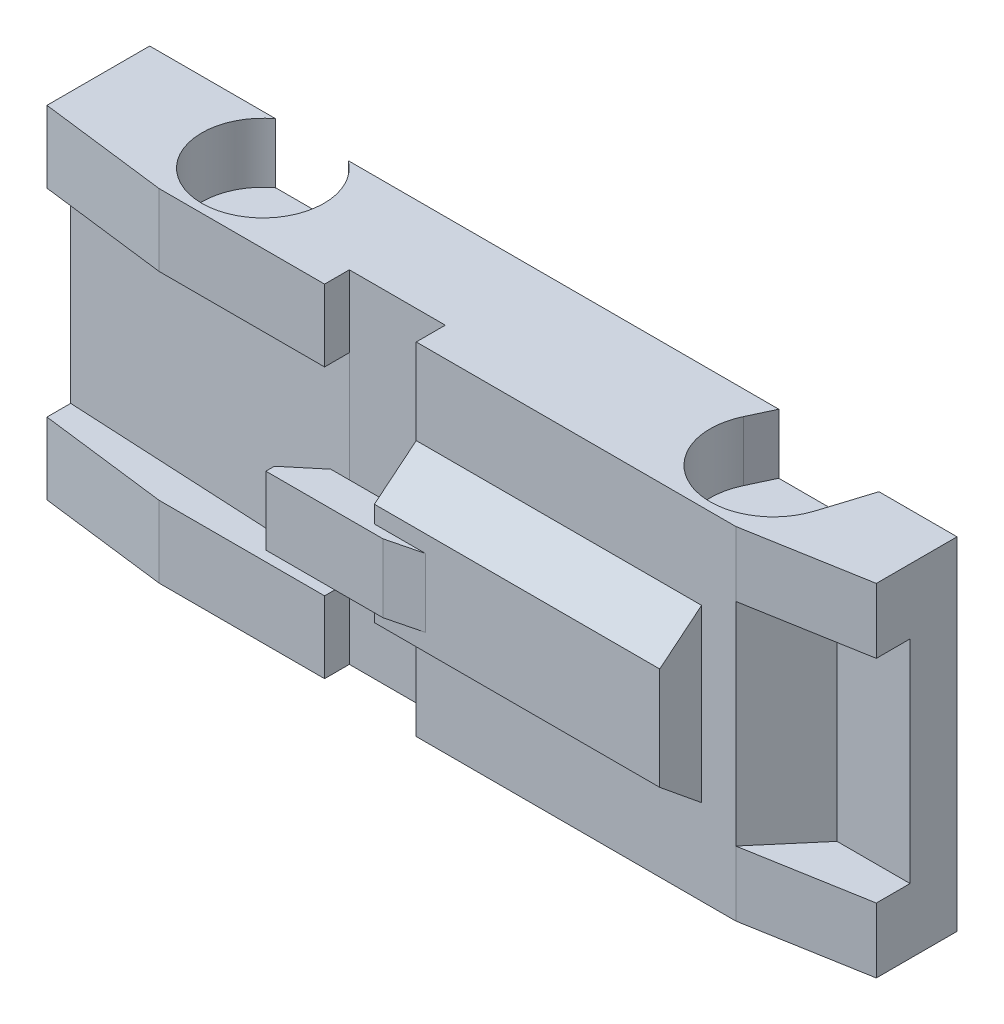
ISO-10303-21;
HEADER;
FILE_DESCRIPTION(('STEP AP214'),'2;1');
FILE_NAME('part.step','',(''),(''),'','','');
FILE_SCHEMA(('AUTOMOTIVE_DESIGN { 1 0 10303 214 1 1 1 1 }'));
ENDSEC;
DATA;
#1=APPLICATION_CONTEXT('core data for automotive mechanical design processes');
#2=APPLICATION_PROTOCOL_DEFINITION('international standard','automotive_design',2000,#1);
#3=PRODUCT_CONTEXT('',#1,'mechanical');
#4=PRODUCT('Part','Part','',(#3));
#5=PRODUCT_RELATED_PRODUCT_CATEGORY('part','',(#4));
#6=PRODUCT_DEFINITION_FORMATION('','',#4);
#7=PRODUCT_DEFINITION_CONTEXT('part definition',#1,'design');
#8=PRODUCT_DEFINITION('design','',#6,#7);
#9=PRODUCT_DEFINITION_SHAPE('','',#8);
#10=(LENGTH_UNIT() NAMED_UNIT(*) SI_UNIT(.MILLI.,.METRE.));
#11=(NAMED_UNIT(*) PLANE_ANGLE_UNIT() SI_UNIT($,.RADIAN.));
#12=(NAMED_UNIT(*) SI_UNIT($,.STERADIAN.) SOLID_ANGLE_UNIT());
#13=UNCERTAINTY_MEASURE_WITH_UNIT(LENGTH_MEASURE(1.E-05),#10,'distance_accuracy_value','');
#14=(GEOMETRIC_REPRESENTATION_CONTEXT(3) GLOBAL_UNCERTAINTY_ASSIGNED_CONTEXT((#13)) GLOBAL_UNIT_ASSIGNED_CONTEXT((#10,
#11,#12)) REPRESENTATION_CONTEXT('',''));
#15=CARTESIAN_POINT('',(0.,0.,0.));
#16=DIRECTION('',(0.,0.,1.));
#17=DIRECTION('',(1.,0.,0.));
#18=AXIS2_PLACEMENT_3D('',#15,#16,#17);
#19=CARTESIAN_POINT('',(3000.00026026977,649.999999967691,299.999324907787));
#20=DIRECTION('',(1.41431573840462E-13,1.,0.));
#21=DIRECTION('',(0.366195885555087,0.,-0.930537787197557));
#22=AXIS2_PLACEMENT_3D('',#19,#20,#21);
#23=CYLINDRICAL_SURFACE('',#22,370.000766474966);
#24=DIRECTION('',(1.41431573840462E-13,1.,0.));
#25=VECTOR('',#24,1.);
#26=CARTESIAN_POINT('',(2864.50750193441,649.999999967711,644.299019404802));
#27=LINE('',#26,#25);
#28=CARTESIAN_POINT('',(2864.50750478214,649.999999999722,644.299012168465));
#29=VERTEX_POINT('',#28);
#30=CARTESIAN_POINT('',(2864.50750478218,1000.00000000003,644.299012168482));
#31=VERTEX_POINT('',#30);
#32=EDGE_CURVE('E65',#29,#31,#27,.T.);
#33=ORIENTED_EDGE('',*,*,#32,.F.);
#34=CARTESIAN_POINT('',(2665.93160378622,649.999999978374,140.945654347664));
#35=CARTESIAN_POINT('',(2657.66569668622,649.99999997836,158.306912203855));
#36=CARTESIAN_POINT('',(2651.23669859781,649.999999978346,176.452683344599));
#37=CARTESIAN_POINT('',(2644.96418128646,649.999999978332,194.156789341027));
#38=CARTESIAN_POINT('',(2640.51155271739,649.999999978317,212.434919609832));
#39=CARTESIAN_POINT('',(2636.18569041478,649.999999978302,230.192671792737));
#40=CARTESIAN_POINT('',(2633.63123285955,649.999999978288,248.290913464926));
#41=CARTESIAN_POINT('',(2631.15905023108,649.999999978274,265.806240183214));
#42=CARTESIAN_POINT('',(2630.36878188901,649.999999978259,283.484469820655));
#43=CARTESIAN_POINT('',(2629.59902900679,649.999999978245,300.703770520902));
#44=CARTESIAN_POINT('',(2630.43433373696,649.999999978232,317.921807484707));
#45=CARTESIAN_POINT('',(2631.29293266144,649.999999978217,335.620004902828));
#46=CARTESIAN_POINT('',(2633.83808909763,649.999999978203,353.152005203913));
#47=CARTESIAN_POINT('',(2636.46864149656,649.999999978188,371.27224519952));
#48=CARTESIAN_POINT('',(2640.86963565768,649.999999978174,389.023466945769));
#49=CARTESIAN_POINT('',(2645.40010349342,649.999999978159,407.296915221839));
#50=CARTESIAN_POINT('',(2651.75391955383,649.999999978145,424.998582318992));
#51=CARTESIAN_POINT('',(2658.25576627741,649.99999997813,443.112661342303));
#52=CARTESIAN_POINT('',(2666.61107261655,649.999999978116,460.473120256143));
#53=CARTESIAN_POINT('',(2675.10419558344,649.999999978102,478.119931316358));
#54=CARTESIAN_POINT('',(2685.43422259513,649.999999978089,494.802131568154));
#55=CARTESIAN_POINT('',(2695.879020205,649.999999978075,511.669677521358));
#56=CARTESIAN_POINT('',(2708.07763760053,649.999999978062,527.333934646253));
#57=CARTESIAN_POINT('',(2720.3598454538,649.99999997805,543.105530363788));
#58=CARTESIAN_POINT('',(2734.25502250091,649.999999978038,557.447331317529));
#59=CARTESIAN_POINT('',(2748.18355952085,649.999999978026,571.823564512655));
#60=CARTESIAN_POINT('',(2763.54910404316,649.999999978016,584.588859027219));
#61=CARTESIAN_POINT('',(2778.8584597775,649.999999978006,597.307473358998));
#62=CARTESIAN_POINT('',(2795.43325872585,649.999999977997,608.305696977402));
#63=CARTESIAN_POINT('',(2811.82213368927,649.999999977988,619.18055055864));
#64=CARTESIAN_POINT('',(2829.30195266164,649.999999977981,628.271005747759));
#65=CARTESIAN_POINT('',(2846.4712142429,649.999999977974,637.199954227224));
#66=CARTESIAN_POINT('',(2864.50775366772,649.999999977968,644.298379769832));
#67=B_SPLINE_CURVE_WITH_KNOTS('',2,(#34,#35,#36,#37,#38,#39,#40,#41,#42,#43,#44,#45,#46,#47,#48,
#49,#50,#51,#52,#53,#54,#55,#56,#57,#58,#59,#60,#61,#62,#63,#64,#65,#66),.UNSPECIFIED.,.F.,.F.,
(3,2,2,2,2,2,2,2,2,2,2,2,2,2,2,2,3),(0.,0.0625,0.125,0.1875,0.25,0.3125,0.375,0.4375,0.5,0.5625,
0.625,0.6875,0.75,0.8125,0.875,0.9375,1.),.UNSPECIFIED.);
#68=CARTESIAN_POINT('',(2665.931603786,649.99999999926,140.94565434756));
#69=VERTEX_POINT('',#68);
#70=EDGE_CURVE('E2026',#69,#29,#67,.T.);
#71=ORIENTED_EDGE('',*,*,#70,.F.);
#72=CARTESIAN_POINT('',(2665.93083532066,649.99999999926,140.945288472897));
#73=CARTESIAN_POINT('',(2665.93083535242,664.583333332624,140.945288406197));
#74=CARTESIAN_POINT('',(2665.93083538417,679.166666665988,140.945288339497));
#75=CARTESIAN_POINT('',(2665.93083544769,708.333333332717,140.945288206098));
#76=CARTESIAN_POINT('',(2665.93083547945,722.916666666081,140.945288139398));
#77=CARTESIAN_POINT('',(2665.93083554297,752.083333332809,140.945288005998));
#78=CARTESIAN_POINT('',(2665.93083557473,766.666666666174,140.945287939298));
#79=CARTESIAN_POINT('',(2665.93083563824,795.833333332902,140.945287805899));
#80=CARTESIAN_POINT('',(2665.93083567,810.416666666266,140.945287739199));
#81=CARTESIAN_POINT('',(2665.93083573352,839.583333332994,140.945287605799));
#82=CARTESIAN_POINT('',(2665.93083576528,854.166666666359,140.9452875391));
#83=CARTESIAN_POINT('',(2665.93083582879,883.333333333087,140.9452874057));
#84=CARTESIAN_POINT('',(2665.93083586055,897.916666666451,140.945287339));
#85=CARTESIAN_POINT('',(2665.93083592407,927.083333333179,140.9452872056));
#86=CARTESIAN_POINT('',(2665.93083595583,941.666666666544,140.945287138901));
#87=CARTESIAN_POINT('',(2665.93083601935,970.833333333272,140.945287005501));
#88=CARTESIAN_POINT('',(2665.9308360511,985.416666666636,140.945286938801));
#89=CARTESIAN_POINT('',(2665.93083608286,1000.,140.945286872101));
#90=B_SPLINE_CURVE_WITH_KNOTS('',3,(#72,#73,#74,#75,#76,#77,#78,#79,#80,#81,#82,#83,#84,#85,#86,
#87,#88,#89),.UNSPECIFIED.,.F.,.F.,(4,2,2,2,2,2,2,2,4),(0.,43.7500000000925,87.5000000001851,
131.250000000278,175.00000000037,218.750000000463,262.500000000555,306.250000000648,
350.00000000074),.UNSPECIFIED.);
#91=CARTESIAN_POINT('',(2665.931604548,1000.,140.9456527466));
#92=VERTEX_POINT('',#91);
#93=EDGE_CURVE('E11',#69,#92,#90,.T.);
#94=ORIENTED_EDGE('',*,*,#93,.T.);
#95=CARTESIAN_POINT('',(2864.50772656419,1000.,644.29844855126));
#96=CARTESIAN_POINT('',(2846.49112570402,1000.,637.208959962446));
#97=CARTESIAN_POINT('',(2829.30185909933,1000.,628.270570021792));
#98=CARTESIAN_POINT('',(2811.82627090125,1000.,619.183293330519));
#99=CARTESIAN_POINT('',(2795.43335649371,1000.,608.305167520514));
#100=CARTESIAN_POINT('',(2778.83770290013,1000.,597.292506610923));
#101=CARTESIAN_POINT('',(2763.54905675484,1000.,584.588881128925));
#102=CARTESIAN_POINT('',(2748.16648054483,1000.,571.807207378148));
#103=CARTESIAN_POINT('',(2734.25459791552,1000.,557.44768925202));
#104=CARTESIAN_POINT('',(2720.36476134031,1000.,543.110926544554));
#105=CARTESIAN_POINT('',(2708.07722084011,1000.,527.334066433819));
#106=CARTESIAN_POINT('',(2695.89341560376,1000.,511.690399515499));
#107=CARTESIAN_POINT('',(2685.4342445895,1000.,494.802034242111));
#108=CARTESIAN_POINT('',(2675.11412440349,1000.,478.138193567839));
#109=CARTESIAN_POINT('',(2666.61158115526,1000.,460.473105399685));
#110=CARTESIAN_POINT('',(2658.25420907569,1000.,443.109628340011));
#111=CARTESIAN_POINT('',(2651.75430495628,1000.,424.998708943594));
#112=CARTESIAN_POINT('',(2645.39387829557,1000.,407.276420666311));
#113=CARTESIAN_POINT('',(2640.86934022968,1000.,389.023282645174));
#114=CARTESIAN_POINT('',(2636.46851660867,1000.,371.269240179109));
#115=CARTESIAN_POINT('',(2633.83787244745,1000.,353.151668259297));
#116=CARTESIAN_POINT('',(2631.29315743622,1000.,335.625901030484));
#117=CARTESIAN_POINT('',(2630.43426532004,1000.,317.92110813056));
#118=CARTESIAN_POINT('',(2629.59902379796,1000.,300.703837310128));
#119=CARTESIAN_POINT('',(2630.36880606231,1000.,283.483828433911));
#120=CARTESIAN_POINT('',(2631.15887637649,1000.,265.809976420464));
#121=CARTESIAN_POINT('',(2633.63166907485,1000.,248.290662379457));
#122=CARTESIAN_POINT('',(2636.18749807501,1000.,230.183050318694));
#123=CARTESIAN_POINT('',(2640.51125573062,1000.,212.435150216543));
#124=CARTESIAN_POINT('',(2644.96329506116,1000.,194.160687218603));
#125=CARTESIAN_POINT('',(2651.23638963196,1000.,176.452772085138));
#126=CARTESIAN_POINT('',(2657.66152056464,1000.,158.315683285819));
#127=CARTESIAN_POINT('',(2665.93160454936,1000.,140.945652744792));
#128=B_SPLINE_CURVE_WITH_KNOTS('',2,(#95,#96,#97,#98,#99,#100,#101,#102,#103,#104,#105,#106,
#107,#108,#109,#110,#111,#112,#113,#114,#115,#116,#117,#118,#119,#120,#121,#122,#123,#124,#125,
#126,#127),.UNSPECIFIED.,.F.,.F.,(3,2,2,2,2,2,2,2,2,2,2,2,2,2,2,2,3),(0.,0.0625,0.125,0.1875,
0.25,0.3125,0.375,0.4375,0.5,0.5625,0.625,0.6875,0.75,0.8125,0.875,0.9375,1.),.UNSPECIFIED.);
#129=EDGE_CURVE('E1992',#31,#92,#128,.T.);
#130=ORIENTED_EDGE('',*,*,#129,.F.);
#131=EDGE_LOOP('',(#33,#71,#94,#130));
#132=FACE_BOUND('',#131,.T.);
#133=ADVANCED_FACE('F44',(#132),#23,.F.);
#134=CARTESIAN_POINT('',(2.92586016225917E-05,649.99999999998,287.50016062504));
#135=DIRECTION('',(0.,-1.,0.));
#136=DIRECTION('',(-2.14256864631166E-08,0.,-1.));
#137=AXIS2_PLACEMENT_3D('',#134,#135,#136);
#138=CYLINDRICAL_SURFACE('',#137,357.500389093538);
#139=DIRECTION('',(0.,1.,0.));
#140=VECTOR('',#139,1.);
#141=CARTESIAN_POINT('',(3.69182929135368E-05,649.99999999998,645.000549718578));
#142=LINE('',#141,#140);
#143=CARTESIAN_POINT('',(3.69182948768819E-05,650.000000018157,645.000639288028));
#144=VERTEX_POINT('',#143);
#145=CARTESIAN_POINT('',(3.69182854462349E-05,1000.,645.000639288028));
#146=VERTEX_POINT('',#145);
#147=EDGE_CURVE('E425',#144,#146,#142,.T.);
#148=ORIENTED_EDGE('',*,*,#147,.F.);
#149=CARTESIAN_POINT('',(3.69183243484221E-05,650.000000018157,645.000549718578));
#150=CARTESIAN_POINT('',(-4.66444770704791,650.000000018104,645.000600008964));
#151=CARTESIAN_POINT('',(-9.32892892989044,650.000000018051,644.90926202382));
#152=CARTESIAN_POINT('',(-18.650747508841,650.000000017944,644.544169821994));
#153=CARTESIAN_POINT('',(-23.308084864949,650.000000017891,644.270415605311));
#154=CARTESIAN_POINT('',(-32.6084786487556,650.000000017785,643.540851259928));
#155=CARTESIAN_POINT('',(-37.2515350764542,650.000000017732,643.085041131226));
#156=CARTESIAN_POINT('',(-46.5162547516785,650.000000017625,641.992079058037));
#157=CARTESIAN_POINT('',(-51.1379179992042,650.000000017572,641.354927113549));
#158=CARTESIAN_POINT('',(-60.3527710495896,650.000000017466,639.900253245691));
#159=CARTESIAN_POINT('',(-64.9459608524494,650.000000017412,639.082731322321));
#160=CARTESIAN_POINT('',(-74.0968305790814,650.000000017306,637.268571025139));
#161=CARTESIAN_POINT('',(-78.6545105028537,650.000000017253,636.271932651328));
#162=CARTESIAN_POINT('',(-87.7273783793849,650.000000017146,634.101065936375));
#163=CARTESIAN_POINT('',(-92.2425663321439,650.000000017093,632.926837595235));
#164=CARTESIAN_POINT('',(-101.223533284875,650.000000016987,630.40258987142));
#165=CARTESIAN_POINT('',(-105.689312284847,650.000000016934,629.052570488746));
#166=CARTESIAN_POINT('',(-114.5646200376,650.000000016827,626.178808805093));
#167=CARTESIAN_POINT('',(-118.97414879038,650.000000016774,624.655066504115));
#168=CARTESIAN_POINT('',(-127.730200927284,650.000000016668,621.436193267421));
#169=CARTESIAN_POINT('',(-132.076724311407,650.000000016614,619.741062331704));
#170=CARTESIAN_POINT('',(-140.700107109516,650.000000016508,616.182008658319));
#171=CARTESIAN_POINT('',(-144.976966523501,650.000000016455,614.318085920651));
#172=CARTESIAN_POINT('',(-153.454469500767,650.000000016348,610.424304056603));
#173=CARTESIAN_POINT('',(-157.655113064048,650.000000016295,608.394444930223));
#174=CARTESIAN_POINT('',(-165.973749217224,650.000000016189,604.171899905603));
#175=CARTESIAN_POINT('',(-170.091741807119,650.000000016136,601.979214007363));
#176=CARTESIAN_POINT('',(-178.238767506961,650.000000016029,597.434374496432));
#177=CARTESIAN_POINT('',(-182.267800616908,650.000000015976,595.08222088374));
#178=CARTESIAN_POINT('',(-190.230735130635,650.00000001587,590.222049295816));
#179=CARTESIAN_POINT('',(-194.164636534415,650.000000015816,587.714031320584));
#180=CARTESIAN_POINT('',(-201.931281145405,650.00000001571,582.545973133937));
#181=CARTESIAN_POINT('',(-205.764024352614,650.000000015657,579.885932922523));
#182=CARTESIAN_POINT('',(-213.322481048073,650.000000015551,574.417905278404));
#183=CARTESIAN_POINT('',(-217.048194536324,650.000000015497,571.609917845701));
#184=CARTESIAN_POINT('',(-224.386884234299,650.000000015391,565.850297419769));
#185=CARTESIAN_POINT('',(-227.999860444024,650.000000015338,562.898664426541));
#186=CARTESIAN_POINT('',(-235.107540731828,650.000000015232,556.856274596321));
#187=CARTESIAN_POINT('',(-238.602244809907,650.000000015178,553.76551775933));
#188=CARTESIAN_POINT('',(-245.468027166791,650.000000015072,547.449615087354));
#189=CARTESIAN_POINT('',(-248.839105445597,650.000000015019,544.22446925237));
#190=CARTESIAN_POINT('',(-255.452471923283,650.000000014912,537.644729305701));
#191=CARTESIAN_POINT('',(-258.694760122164,650.000000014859,534.290135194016));
#192=CARTESIAN_POINT('',(-265.045579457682,650.000000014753,527.456637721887));
#193=CARTESIAN_POINT('',(-268.154110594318,650.0000000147,523.977734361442));
#194=CARTESIAN_POINT('',(-274.232653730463,650.000000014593,516.900947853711));
#195=CARTESIAN_POINT('',(-277.202665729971,650.00000001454,513.303064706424));
#196=CARTESIAN_POINT('',(-282.999620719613,650.000000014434,505.993830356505));
#197=CARTESIAN_POINT('',(-285.826563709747,650.000000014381,502.282479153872));
#198=CARTESIAN_POINT('',(-291.333049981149,650.000000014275,494.751994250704));
#199=CARTESIAN_POINT('',(-294.012593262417,650.000000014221,490.932860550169));
#200=CARTESIAN_POINT('',(-299.220175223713,650.000000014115,483.192661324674));
#201=CARTESIAN_POINT('',(-301.748213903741,650.000000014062,479.271595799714));
#202=CARTESIAN_POINT('',(-306.648913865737,650.000000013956,471.333539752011));
#203=CARTESIAN_POINT('',(-309.021575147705,650.000000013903,467.316549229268));
#204=CARTESIAN_POINT('',(-313.607885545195,650.000000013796,459.192796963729));
#205=CARTESIAN_POINT('',(-315.821534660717,650.000000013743,455.086035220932));
#206=CARTESIAN_POINT('',(-320.086429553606,650.000000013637,446.789031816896));
#207=CARTESIAN_POINT('',(-322.137675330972,650.000000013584,442.598790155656));
#208=CARTESIAN_POINT('',(-326.074621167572,650.000000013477,434.141246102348));
#209=CARTESIAN_POINT('',(-327.960321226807,650.000000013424,429.873943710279));
#210=CARTESIAN_POINT('',(-331.563286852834,650.000000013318,421.268815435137));
#211=CARTESIAN_POINT('',(-333.280552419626,650.000000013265,416.930989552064));
#212=CARTESIAN_POINT('',(-336.544018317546,650.000000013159,408.191459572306));
#213=CARTESIAN_POINT('',(-338.090218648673,650.000000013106,403.789755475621));
#214=CARTESIAN_POINT('',(-341.009185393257,650.000000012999,394.929212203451));
#215=CARTESIAN_POINT('',(-342.381951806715,650.000000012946,390.470373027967));
#216=CARTESIAN_POINT('',(-344.951947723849,650.00000001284,381.502390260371));
#217=CARTESIAN_POINT('',(-346.149177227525,650.000000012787,376.99324666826));
#218=CARTESIAN_POINT('',(-348.366265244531,650.000000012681,367.931562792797));
#219=CARTESIAN_POINT('',(-349.386123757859,650.000000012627,363.379022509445));
#220=CARTESIAN_POINT('',(-351.246907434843,650.000000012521,354.237519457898));
#221=CARTESIAN_POINT('',(-352.087832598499,650.000000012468,349.648556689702));
#222=CARTESIAN_POINT('',(-353.589461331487,650.000000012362,340.44123867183));
#223=CARTESIAN_POINT('',(-354.25016490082,650.000000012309,335.822883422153));
#224=CARTESIAN_POINT('',(-355.390338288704,650.000000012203,326.563855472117));
#225=CARTESIAN_POINT('',(-355.869808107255,650.000000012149,321.923182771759));
#226=CARTESIAN_POINT('',(-356.646779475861,650.000000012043,312.626629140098));
#227=CARTESIAN_POINT('',(-356.944281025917,650.00000001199,307.970748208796));
#228=CARTESIAN_POINT('',(-357.356860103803,650.000000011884,298.65091063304));
#229=CARTESIAN_POINT('',(-357.471937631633,650.000000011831,293.986953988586));
#230=CARTESIAN_POINT('',(-357.519492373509,650.000000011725,284.658109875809));
#231=CARTESIAN_POINT('',(-357.451969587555,650.000000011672,279.993222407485));
#232=CARTESIAN_POINT('',(-357.134427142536,650.000000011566,270.669662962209));
#233=CARTESIAN_POINT('',(-356.884407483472,650.000000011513,266.010990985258));
#234=CARTESIAN_POINT('',(-356.202254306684,650.000000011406,256.706999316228));
#235=CARTESIAN_POINT('',(-355.77012078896,650.000000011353,252.06167962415));
#236=CARTESIAN_POINT('',(-354.724401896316,650.000000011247,242.791508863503));
#237=CARTESIAN_POINT('',(-354.110816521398,650.000000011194,238.166657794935));
#238=CARTESIAN_POINT('',(-352.703133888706,650.000000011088,228.944509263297));
#239=CARTESIAN_POINT('',(-351.909036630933,650.000000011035,224.347211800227));
#240=CARTESIAN_POINT('',(-350.141546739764,650.000000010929,215.187213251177));
#241=CARTESIAN_POINT('',(-349.168154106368,650.000000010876,210.624512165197));
#242=CARTESIAN_POINT('',(-347.043564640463,650.00000001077,201.540696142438));
#243=CARTESIAN_POINT('',(-345.892367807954,650.000000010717,197.019581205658));
#244=CARTESIAN_POINT('',(-343.413933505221,650.000000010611,188.025863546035));
#245=CARTESIAN_POINT('',(-342.086696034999,650.000000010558,183.553260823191));
#246=CARTESIAN_POINT('',(-339.258213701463,650.000000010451,174.663419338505));
#247=CARTESIAN_POINT('',(-337.75696883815,650.000000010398,170.246180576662));
#248=CARTESIAN_POINT('',(-334.582771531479,650.000000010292,161.473833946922));
#249=CARTESIAN_POINT('',(-332.909819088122,650.000000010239,157.118726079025));
#250=CARTESIAN_POINT('',(-329.394769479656,650.000000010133,148.47731298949));
#251=CARTESIAN_POINT('',(-327.552672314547,650.00000001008,144.191007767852));
#252=CARTESIAN_POINT('',(-323.702155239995,650.000000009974,135.693766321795));
#253=CARTESIAN_POINT('',(-321.69373533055,650.000000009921,131.482830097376));
#254=CARTESIAN_POINT('',(-317.513649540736,650.000000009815,123.142777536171));
#255=CARTESIAN_POINT('',(-315.341983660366,650.000000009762,119.013661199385));
#256=CARTESIAN_POINT('',(-310.838732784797,650.000000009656,110.843573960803));
#257=CARTESIAN_POINT('',(-308.507147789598,650.000000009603,106.802603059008));
#258=CARTESIAN_POINT('',(-303.687630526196,650.000000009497,98.8149972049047));
#259=CARTESIAN_POINT('',(-301.199698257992,650.000000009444,94.8683622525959));
#260=CARTESIAN_POINT('',(-296.071297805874,650.000000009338,87.0754742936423));
#261=CARTESIAN_POINT('',(-293.430829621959,650.000000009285,83.2292212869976));
#262=CARTESIAN_POINT('',(-288.001402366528,650.000000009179,75.6429894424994));
#263=CARTESIAN_POINT('',(-285.212443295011,650.000000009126,71.9030106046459));
#264=CARTESIAN_POINT('',(-279.490306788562,650.00000000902,64.5350564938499));
#265=CARTESIAN_POINT('',(-276.55712935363,650.000000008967,60.9070812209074));
#266=CARTESIAN_POINT('',(-270.551049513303,650.000000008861,53.768692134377));
#267=CARTESIAN_POINT('',(-267.478147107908,650.000000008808,50.2582783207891));
#268=CARTESIAN_POINT('',(-261.197325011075,650.000000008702,43.3603896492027));
#269=CARTESIAN_POINT('',(-257.989405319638,650.000000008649,39.9729147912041));
#270=CARTESIAN_POINT('',(-251.44346227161,650.000000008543,33.326094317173));
#271=CARTESIAN_POINT('',(-248.105438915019,650.00000000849,30.0667487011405));
#272=CARTESIAN_POINT('',(-241.30440483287,650.000000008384,23.6811765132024));
#273=CARTESIAN_POINT('',(-237.841394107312,650.000000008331,20.5549499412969));
#274=CARTESIAN_POINT('',(-230.795680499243,650.000000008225,14.4404173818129));
#275=CARTESIAN_POINT('',(-227.212977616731,650.000000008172,11.4521113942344));
#276=CARTESIAN_POINT('',(-219.933405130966,650.000000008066,5.61795178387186));
#277=CARTESIAN_POINT('',(-216.236535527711,650.000000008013,2.77209816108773));
#278=CARTESIAN_POINT('',(-212.48534528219,650.00000000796,-0.000263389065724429));
#279=B_SPLINE_CURVE_WITH_KNOTS('',3,(#149,#150,#151,#152,#153,#154,#155,#156,#157,#158,#159,
#160,#161,#162,#163,#164,#165,#166,#167,#168,#169,#170,#171,#172,#173,#174,#175,#176,#177,#178,
#179,#180,#181,#182,#183,#184,#185,#186,#187,#188,#189,#190,#191,#192,#193,#194,#195,#196,#197,
#198,#199,#200,#201,#202,#203,#204,#205,#206,#207,#208,#209,#210,#211,#212,#213,#214,#215,#216,
#217,#218,#219,#220,#221,#222,#223,#224,#225,#226,#227,#228,#229,#230,#231,#232,#233,#234,#235,
#236,#237,#238,#239,#240,#241,#242,#243,#244,#245,#246,#247,#248,#249,#250,#251,#252,#253,#254,
#255,#256,#257,#258,#259,#260,#261,#262,#263,#264,#265,#266,#267,#268,#269,#270,#271,#272,#273,
#274,#275,#276,#277,#278),.UNSPECIFIED.,.F.,.F.,(4,2,2,2,2,2,2,2,2,2,2,2,2,2,2,2,2,2,2,2,2,2,2,
2,2,2,2,2,2,2,2,2,2,2,2,2,2,2,2,2,2,2,2,2,2,2,2,2,2,2,2,2,2,2,2,2,2,2,2,2,2,2,2,2,4),(0.,
13.9925548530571,27.985109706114,41.9776645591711,55.9702194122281,69.9627742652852,
83.9553291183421,97.9478839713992,111.940438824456,125.932993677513,139.92554853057,
153.918103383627,167.910658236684,181.903213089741,195.895767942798,209.888322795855,
223.880877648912,237.873432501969,251.865987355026,265.858542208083,279.85109706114,
293.843651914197,307.836206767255,321.828761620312,335.821316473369,349.813871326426,
363.806426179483,377.79898103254,391.791535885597,405.784090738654,419.776645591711,
433.769200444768,447.761755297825,461.754310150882,475.746865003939,489.739419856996,
503.731974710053,517.72452956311,531.717084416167,545.709639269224,559.702194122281,
573.694748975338,587.687303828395,601.679858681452,615.672413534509,629.664968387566,
643.657523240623,657.65007809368,671.642632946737,685.635187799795,699.627742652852,
713.620297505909,727.612852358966,741.605407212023,755.59796206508,769.590516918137,
783.583071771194,797.575626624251,811.568181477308,825.560736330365,839.553291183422,
853.545846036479,867.538400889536,881.530955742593,895.52351059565),.UNSPECIFIED.);
#280=CARTESIAN_POINT('',(-212.4851506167,650.00000000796,0.));
#281=VERTEX_POINT('',#280);
#282=EDGE_CURVE('E57',#144,#281,#279,.T.);
#283=ORIENTED_EDGE('',*,*,#282,.T.);
#284=CARTESIAN_POINT('',(-212.4851506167,1000.,0.));
#285=DIRECTION('',(0.,-1.,0.));
#286=VECTOR('',#285,1.);
#287=LINE('',#284,#286);
#288=CARTESIAN_POINT('',(-212.4851506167,1000.,-1.855E-12));
#289=VERTEX_POINT('',#288);
#290=EDGE_CURVE('E306',#289,#281,#287,.T.);
#291=ORIENTED_EDGE('',*,*,#290,.F.);
#292=CARTESIAN_POINT('',(2.92585922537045E-05,1000.00000000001,287.50016062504));
#293=DIRECTION('',(0.,1.,0.));
#294=DIRECTION('',(-0.594364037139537,0.,-0.804196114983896));
#295=AXIS2_PLACEMENT_3D('',#292,#293,#294);
#296=CIRCLE('',#295,357.500389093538);
#297=EDGE_CURVE('E274',#289,#146,#296,.T.);
#298=ORIENTED_EDGE('',*,*,#297,.T.);
#299=EDGE_LOOP('',(#148,#283,#291,#298));
#300=FACE_BOUND('',#299,.T.);
#301=ADVANCED_FACE('F443',(#300),#138,.F.);
#302=CARTESIAN_POINT('',(3430.,682.,450.));
#303=DIRECTION('',(-0.761243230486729,0.,-0.64846645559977));
#304=DIRECTION('',(-0.64846645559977,0.,0.761243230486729));
#305=AXIS2_PLACEMENT_3D('',#302,#303,#304);
#306=PLANE('',#305);
#307=DIRECTION('',(0.,1.,0.));
#308=VECTOR('',#307,1.);
#309=CARTESIAN_POINT('',(3200.,-100.,720.));
#310=LINE('',#309,#308);
#311=CARTESIAN_POINT('',(3200.,-620.,720.));
#312=VERTEX_POINT('',#311);
#313=CARTESIAN_POINT('',(3200.,620.,720.));
#314=VERTEX_POINT('',#313);
#315=EDGE_CURVE('E275',#312,#314,#310,.T.);
#316=ORIENTED_EDGE('',*,*,#315,.F.);
#317=DIRECTION('',(-0.64846645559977,0.,0.76124323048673));
#318=VECTOR('',#317,1.);
#319=CARTESIAN_POINT('',(3430.,-620.,450.));
#320=LINE('',#319,#318);
#321=CARTESIAN_POINT('',(3472.592592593,-620.,400.));
#322=VERTEX_POINT('',#321);
#323=EDGE_CURVE('E774',#322,#312,#320,.T.);
#324=ORIENTED_EDGE('',*,*,#323,.F.);
#325=DIRECTION('',(0.,-1.,0.));
#326=VECTOR('',#325,1.);
#327=CARTESIAN_POINT('',(3472.592592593,682.,400.));
#328=LINE('',#327,#326);
#329=CARTESIAN_POINT('',(3472.592592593,620.,400.));
#330=VERTEX_POINT('',#329);
#331=EDGE_CURVE('E319',#330,#322,#328,.T.);
#332=ORIENTED_EDGE('',*,*,#331,.F.);
#333=DIRECTION('',(-0.64846645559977,0.,0.76124323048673));
#334=VECTOR('',#333,1.);
#335=CARTESIAN_POINT('',(3430.,620.,450.));
#336=LINE('',#335,#334);
#337=EDGE_CURVE('E270',#330,#314,#336,.T.);
#338=ORIENTED_EDGE('',*,*,#337,.T.);
#339=EDGE_LOOP('',(#316,#324,#332,#338));
#340=FACE_BOUND('',#339,.T.);
#341=ADVANCED_FACE('F560',(#340),#306,.F.);
#342=CARTESIAN_POINT('',(4000.,1100.,720.));
#343=DIRECTION('',(0.,0.,-1.));
#344=DIRECTION('',(0.,-1.,0.));
#345=AXIS2_PLACEMENT_3D('',#342,#343,#344);
#346=PLANE('',#345);
#347=DIRECTION('',(0.,1.,0.));
#348=VECTOR('',#347,1.);
#349=CARTESIAN_POINT('',(3000.,-100.,720.));
#350=LINE('',#349,#348);
#351=CARTESIAN_POINT('',(3000.,-500.,720.));
#352=VERTEX_POINT('',#351);
#353=CARTESIAN_POINT('',(3000.,500.,720.));
#354=VERTEX_POINT('',#353);
#355=EDGE_CURVE('E408',#352,#354,#350,.T.);
#356=ORIENTED_EDGE('',*,*,#355,.F.);
#357=DIRECTION('',(-1.,0.,0.));
#358=VECTOR('',#357,1.);
#359=CARTESIAN_POINT('',(4000.,-500.,720.));
#360=LINE('',#359,#358);
#361=CARTESIAN_POINT('',(1330.,-500.,720.));
#362=VERTEX_POINT('',#361);
#363=EDGE_CURVE('E1005',#352,#362,#360,.T.);
#364=ORIENTED_EDGE('',*,*,#363,.T.);
#365=DIRECTION('',(0.,-1.,0.));
#366=VECTOR('',#365,1.);
#367=CARTESIAN_POINT('',(1330.,100.,720.));
#368=LINE('',#367,#366);
#369=CARTESIAN_POINT('',(1330.,-1000.,720.));
#370=VERTEX_POINT('',#369);
#371=EDGE_CURVE('E1193',#362,#370,#368,.T.);
#372=ORIENTED_EDGE('',*,*,#371,.T.);
#373=DIRECTION('',(1.,0.,0.));
#374=VECTOR('',#373,1.);
#375=CARTESIAN_POINT('',(4000.,-1000.,720.));
#376=LINE('',#375,#374);
#377=CARTESIAN_POINT('',(3200.,-1000.,720.));
#378=VERTEX_POINT('',#377);
#379=EDGE_CURVE('E1063',#370,#378,#376,.T.);
#380=ORIENTED_EDGE('',*,*,#379,.T.);
#381=DIRECTION('',(0.,-1.,0.));
#382=VECTOR('',#381,1.);
#383=CARTESIAN_POINT('',(3200.,-1100.,720.));
#384=LINE('',#383,#382);
#385=EDGE_CURVE('E1042',#312,#378,#384,.T.);
#386=ORIENTED_EDGE('',*,*,#385,.F.);
#387=ORIENTED_EDGE('',*,*,#315,.T.);
#388=DIRECTION('',(0.,1.,0.));
#389=VECTOR('',#388,1.);
#390=CARTESIAN_POINT('',(3200.,1100.,720.));
#391=LINE('',#390,#389);
#392=CARTESIAN_POINT('',(3200.,1000.,720.));
#393=VERTEX_POINT('',#392);
#394=EDGE_CURVE('E338',#314,#393,#391,.T.);
#395=ORIENTED_EDGE('',*,*,#394,.T.);
#396=DIRECTION('',(1.,0.,0.));
#397=VECTOR('',#396,1.);
#398=CARTESIAN_POINT('',(4000.,1000.,720.));
#399=LINE('',#398,#397);
#400=CARTESIAN_POINT('',(1330.,1000.,720.));
#401=VERTEX_POINT('',#400);
#402=EDGE_CURVE('E378',#401,#393,#399,.T.);
#403=ORIENTED_EDGE('',*,*,#402,.F.);
#404=DIRECTION('',(0.,1.,0.));
#405=VECTOR('',#404,1.);
#406=CARTESIAN_POINT('',(1330.,-100.,720.));
#407=LINE('',#406,#405);
#408=CARTESIAN_POINT('',(1330.,500.,720.));
#409=VERTEX_POINT('',#408);
#410=EDGE_CURVE('E248',#409,#401,#407,.T.);
#411=ORIENTED_EDGE('',*,*,#410,.F.);
#412=DIRECTION('',(-1.,0.,0.));
#413=VECTOR('',#412,1.);
#414=CARTESIAN_POINT('',(4000.,500.,720.));
#415=LINE('',#414,#413);
#416=EDGE_CURVE('E258',#354,#409,#415,.T.);
#417=ORIENTED_EDGE('',*,*,#416,.F.);
#418=EDGE_LOOP('',(#356,#364,#372,#380,#386,#387,#395,#403,#411,#417));
#419=FACE_BOUND('',#418,.T.);
#420=ADVANCED_FACE('F1690',(#419),#346,.F.);
#421=CARTESIAN_POINT('',(3000.,0.,0.));
#422=DIRECTION('',(1.,0.,0.));
#423=DIRECTION('',(0.,1.,0.));
#424=AXIS2_PLACEMENT_3D('',#421,#422,#423);
#425=PLANE('',#424);
#426=DIRECTION('',(0.,-1.,0.));
#427=VECTOR('',#426,1.);
#428=CARTESIAN_POINT('',(3000.,-100.,965.));
#429=LINE('',#428,#427);
#430=CARTESIAN_POINT('',(3000.,300.,965.));
#431=VERTEX_POINT('',#430);
#432=CARTESIAN_POINT('',(3000.,-300.,965.));
#433=VERTEX_POINT('',#432);
#434=EDGE_CURVE('E356',#431,#433,#429,.T.);
#435=ORIENTED_EDGE('',*,*,#434,.T.);
#436=DIRECTION('',(0.,-0.632376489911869,-0.774661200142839));
#437=VECTOR('',#436,1.);
#438=CARTESIAN_POINT('',(3000.,-400.,842.5));
#439=LINE('',#438,#437);
#440=EDGE_CURVE('E1009',#433,#352,#439,.T.);
#441=ORIENTED_EDGE('',*,*,#440,.T.);
#442=ORIENTED_EDGE('',*,*,#355,.T.);
#443=DIRECTION('',(0.,0.632376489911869,-0.774661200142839));
#444=VECTOR('',#443,1.);
#445=CARTESIAN_POINT('',(3000.,400.,842.5));
#446=LINE('',#445,#444);
#447=EDGE_CURVE('E296',#431,#354,#446,.T.);
#448=ORIENTED_EDGE('',*,*,#447,.F.);
#449=EDGE_LOOP('',(#435,#441,#442,#448));
#450=FACE_BOUND('',#449,.T.);
#451=ADVANCED_FACE('F1681',(#450),#425,.T.);
#452=CARTESIAN_POINT('',(0.,0.,965.));
#453=DIRECTION('',(0.,0.,1.));
#454=DIRECTION('',(1.,0.,0.));
#455=AXIS2_PLACEMENT_3D('',#452,#453,#454);
#456=PLANE('',#455);
#457=DIRECTION('',(0.,1.,0.));
#458=VECTOR('',#457,1.);
#459=CARTESIAN_POINT('',(1630.,100.,965.));
#460=LINE('',#459,#458);
#461=CARTESIAN_POINT('',(1630.,-200.,965.));
#462=VERTEX_POINT('',#461);
#463=CARTESIAN_POINT('',(1630.,200.,965.));
#464=VERTEX_POINT('',#463);
#465=EDGE_CURVE('E208',#462,#464,#460,.T.);
#466=ORIENTED_EDGE('',*,*,#465,.F.);
#467=DIRECTION('',(-1.,0.,0.));
#468=VECTOR('',#467,1.);
#469=CARTESIAN_POINT('',(1630.,-200.,965.));
#470=LINE('',#469,#468);
#471=CARTESIAN_POINT('',(1330.,-200.,965.));
#472=VERTEX_POINT('',#471);
#473=EDGE_CURVE('E1058',#462,#472,#470,.T.);
#474=ORIENTED_EDGE('',*,*,#473,.T.);
#475=DIRECTION('',(0.,1.,0.));
#476=VECTOR('',#475,1.);
#477=CARTESIAN_POINT('',(1330.,100.,965.));
#478=LINE('',#477,#476);
#479=CARTESIAN_POINT('',(1330.,-300.,965.));
#480=VERTEX_POINT('',#479);
#481=EDGE_CURVE('E1043',#480,#472,#478,.T.);
#482=ORIENTED_EDGE('',*,*,#481,.F.);
#483=DIRECTION('',(-1.,0.,0.));
#484=VECTOR('',#483,1.);
#485=CARTESIAN_POINT('',(1200.,-300.,965.));
#486=LINE('',#485,#484);
#487=EDGE_CURVE('E1039',#433,#480,#486,.T.);
#488=ORIENTED_EDGE('',*,*,#487,.F.);
#489=ORIENTED_EDGE('',*,*,#434,.F.);
#490=DIRECTION('',(-1.,0.,0.));
#491=VECTOR('',#490,1.);
#492=CARTESIAN_POINT('',(1200.,300.,965.));
#493=LINE('',#492,#491);
#494=CARTESIAN_POINT('',(1330.,300.,965.));
#495=VERTEX_POINT('',#494);
#496=EDGE_CURVE('E353',#431,#495,#493,.T.);
#497=ORIENTED_EDGE('',*,*,#496,.T.);
#498=DIRECTION('',(0.,-1.,0.));
#499=VECTOR('',#498,1.);
#500=CARTESIAN_POINT('',(1330.,-100.,965.));
#501=LINE('',#500,#499);
#502=CARTESIAN_POINT('',(1330.,200.,965.));
#503=VERTEX_POINT('',#502);
#504=EDGE_CURVE('E212',#495,#503,#501,.T.);
#505=ORIENTED_EDGE('',*,*,#504,.T.);
#506=DIRECTION('',(-1.,0.,0.));
#507=VECTOR('',#506,1.);
#508=CARTESIAN_POINT('',(1630.,200.,965.));
#509=LINE('',#508,#507);
#510=EDGE_CURVE('E204',#464,#503,#509,.T.);
#511=ORIENTED_EDGE('',*,*,#510,.F.);
#512=EDGE_LOOP('',(#466,#474,#482,#488,#489,#497,#505,#511));
#513=FACE_BOUND('',#512,.T.);
#514=ADVANCED_FACE('F46',(#513),#456,.T.);
#515=CARTESIAN_POINT('',(1530.,100.,990.));
#516=DIRECTION('',(-0.242535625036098,0.,-0.970142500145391));
#517=DIRECTION('',(-0.970142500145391,0.,0.242535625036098));
#518=AXIS2_PLACEMENT_3D('',#515,#516,#517);
#519=PLANE('',#518);
#520=DIRECTION('',(0.,1.,0.));
#521=VECTOR('',#520,1.);
#522=CARTESIAN_POINT('',(1430.,100.,1015.));
#523=LINE('',#522,#521);
#524=CARTESIAN_POINT('',(1430.,-200.,1015.));
#525=VERTEX_POINT('',#524);
#526=CARTESIAN_POINT('',(1430.,200.,1015.));
#527=VERTEX_POINT('',#526);
#528=EDGE_CURVE('E237',#525,#527,#523,.T.);
#529=ORIENTED_EDGE('',*,*,#528,.F.);
#530=DIRECTION('',(-0.970142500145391,0.,0.242535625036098));
#531=VECTOR('',#530,1.);
#532=CARTESIAN_POINT('',(1530.,-200.,990.));
#533=LINE('',#532,#531);
#534=EDGE_CURVE('E228',#462,#525,#533,.T.);
#535=ORIENTED_EDGE('',*,*,#534,.F.);
#536=ORIENTED_EDGE('',*,*,#465,.T.);
#537=DIRECTION('',(-0.970142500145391,0.,0.242535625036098));
#538=VECTOR('',#537,1.);
#539=CARTESIAN_POINT('',(1530.,200.,990.));
#540=LINE('',#539,#538);
#541=EDGE_CURVE('E225',#464,#527,#540,.T.);
#542=ORIENTED_EDGE('',*,*,#541,.T.);
#543=EDGE_LOOP('',(#529,#535,#536,#542));
#544=FACE_BOUND('',#543,.T.);
#545=ADVANCED_FACE('F224',(#544),#519,.F.);
#546=CARTESIAN_POINT('',(0.,0.,1015.));
#547=DIRECTION('',(0.,0.,1.));
#548=DIRECTION('',(1.,0.,0.));
#549=AXIS2_PLACEMENT_3D('',#546,#547,#548);
#550=PLANE('',#549);
#551=DIRECTION('',(0.,-1.,0.));
#552=VECTOR('',#551,1.);
#553=CARTESIAN_POINT('',(745.,-2.0588E-13,1015.));
#554=LINE('',#553,#552);
#555=CARTESIAN_POINT('',(745.,200.,1015.));
#556=VERTEX_POINT('',#555);
#557=CARTESIAN_POINT('',(745.,-200.,1015.));
#558=VERTEX_POINT('',#557);
#559=EDGE_CURVE('E259',#556,#558,#554,.T.);
#560=ORIENTED_EDGE('',*,*,#559,.T.);
#561=DIRECTION('',(-1.,0.,0.));
#562=VECTOR('',#561,1.);
#563=CARTESIAN_POINT('',(1630.,-200.,1015.));
#564=LINE('',#563,#562);
#565=EDGE_CURVE('E1085',#525,#558,#564,.T.);
#566=ORIENTED_EDGE('',*,*,#565,.F.);
#567=ORIENTED_EDGE('',*,*,#528,.T.);
#568=DIRECTION('',(-1.,0.,0.));
#569=VECTOR('',#568,1.);
#570=CARTESIAN_POINT('',(1630.,200.,1015.));
#571=LINE('',#570,#569);
#572=EDGE_CURVE('E235',#527,#556,#571,.T.);
#573=ORIENTED_EDGE('',*,*,#572,.T.);
#574=EDGE_LOOP('',(#560,#566,#567,#573));
#575=FACE_BOUND('',#574,.T.);
#576=ADVANCED_FACE('F1653',(#575),#550,.T.);
#577=CARTESIAN_POINT('',(745.,-2.0588E-13,1015.));
#578=DIRECTION('',(1.,0.,0.));
#579=DIRECTION('',(0.,0.,1.));
#580=AXIS2_PLACEMENT_3D('',#577,#578,#579);
#581=PLANE('',#580);
#582=DIRECTION('',(0.,-1.,0.));
#583=VECTOR('',#582,1.);
#584=CARTESIAN_POINT('',(745.,-2.0588E-13,965.));
#585=LINE('',#584,#583);
#586=CARTESIAN_POINT('',(745.,200.,965.));
#587=VERTEX_POINT('',#586);
#588=CARTESIAN_POINT('',(745.,-200.,965.));
#589=VERTEX_POINT('',#588);
#590=EDGE_CURVE('E263',#587,#589,#585,.T.);
#591=ORIENTED_EDGE('',*,*,#590,.T.);
#592=DIRECTION('',(0.,0.,1.));
#593=VECTOR('',#592,1.);
#594=CARTESIAN_POINT('',(745.,-200.,1015.));
#595=LINE('',#594,#593);
#596=EDGE_CURVE('E1054',#589,#558,#595,.T.);
#597=ORIENTED_EDGE('',*,*,#596,.T.);
#598=ORIENTED_EDGE('',*,*,#559,.F.);
#599=DIRECTION('',(0.,0.,1.));
#600=VECTOR('',#599,1.);
#601=CARTESIAN_POINT('',(745.,200.,1015.));
#602=LINE('',#601,#600);
#603=EDGE_CURVE('E218',#587,#556,#602,.T.);
#604=ORIENTED_EDGE('',*,*,#603,.F.);
#605=EDGE_LOOP('',(#591,#597,#598,#604));
#606=FACE_BOUND('',#605,.T.);
#607=ADVANCED_FACE('F838',(#606),#581,.F.);
#608=CARTESIAN_POINT('',(835.,175.,890.));
#609=DIRECTION('',(0.640184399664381,0.,0.768221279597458));
#610=DIRECTION('',(0.,-1.,0.));
#611=AXIS2_PLACEMENT_3D('',#608,#609,#610);
#612=PLANE('',#611);
#613=DIRECTION('',(0.,1.,0.));
#614=VECTOR('',#613,1.);
#615=CARTESIAN_POINT('',(925.,200.,815.));
#616=LINE('',#615,#614);
#617=CARTESIAN_POINT('',(925.,-200.,815.));
#618=VERTEX_POINT('',#617);
#619=CARTESIAN_POINT('',(925.,200.,815.));
#620=VERTEX_POINT('',#619);
#621=EDGE_CURVE('E281',#618,#620,#616,.T.);
#622=ORIENTED_EDGE('',*,*,#621,.F.);
#623=DIRECTION('',(-0.768221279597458,0.,0.640184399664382));
#624=VECTOR('',#623,1.);
#625=CARTESIAN_POINT('',(835.,-200.,890.));
#626=LINE('',#625,#624);
#627=EDGE_CURVE('E1027',#618,#589,#626,.T.);
#628=ORIENTED_EDGE('',*,*,#627,.T.);
#629=ORIENTED_EDGE('',*,*,#590,.F.);
#630=DIRECTION('',(-0.768221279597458,0.,0.640184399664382));
#631=VECTOR('',#630,1.);
#632=CARTESIAN_POINT('',(835.,200.,890.));
#633=LINE('',#632,#631);
#634=EDGE_CURVE('E292',#620,#587,#633,.T.);
#635=ORIENTED_EDGE('',*,*,#634,.F.);
#636=EDGE_LOOP('',(#622,#628,#629,#635));
#637=FACE_BOUND('',#636,.T.);
#638=ADVANCED_FACE('F1633',(#637),#612,.F.);
#639=CARTESIAN_POINT('',(1600.,200.,815.));
#640=DIRECTION('',(0.,0.,1.));
#641=DIRECTION('',(1.,0.,0.));
#642=AXIS2_PLACEMENT_3D('',#639,#640,#641);
#643=PLANE('',#642);
#644=DIRECTION('',(0.,1.,0.));
#645=VECTOR('',#644,1.);
#646=CARTESIAN_POINT('',(1330.,-1.90947E-12,815.));
#647=LINE('',#646,#645);
#648=CARTESIAN_POINT('',(1330.,-200.,815.));
#649=VERTEX_POINT('',#648);
#650=CARTESIAN_POINT('',(1330.,200.,815.));
#651=VERTEX_POINT('',#650);
#652=EDGE_CURVE('E334',#649,#651,#647,.T.);
#653=ORIENTED_EDGE('',*,*,#652,.F.);
#654=DIRECTION('',(1.,0.,0.));
#655=VECTOR('',#654,1.);
#656=CARTESIAN_POINT('',(1600.,-200.,815.));
#657=LINE('',#656,#655);
#658=EDGE_CURVE('E1088',#618,#649,#657,.T.);
#659=ORIENTED_EDGE('',*,*,#658,.F.);
#660=ORIENTED_EDGE('',*,*,#621,.T.);
#661=DIRECTION('',(1.,0.,0.));
#662=VECTOR('',#661,1.);
#663=CARTESIAN_POINT('',(1600.,200.,815.));
#664=LINE('',#663,#662);
#665=EDGE_CURVE('E285',#620,#651,#664,.T.);
#666=ORIENTED_EDGE('',*,*,#665,.T.);
#667=EDGE_LOOP('',(#653,#659,#660,#666));
#668=FACE_BOUND('',#667,.T.);
#669=ADVANCED_FACE('F710',(#668),#643,.F.);
#670=CARTESIAN_POINT('',(1330.,-100.,2.2737E-13));
#671=DIRECTION('',(1.,0.,0.));
#672=DIRECTION('',(0.,1.,0.));
#673=AXIS2_PLACEMENT_3D('',#670,#671,#672);
#674=PLANE('',#673);
#675=DIRECTION('',(0.,1.,0.));
#676=VECTOR('',#675,1.);
#677=CARTESIAN_POINT('',(1330.,-1.32374E-12,550.));
#678=LINE('',#677,#676);
#679=CARTESIAN_POINT('',(1330.,-1000.,550.));
#680=VERTEX_POINT('',#679);
#681=CARTESIAN_POINT('',(1330.,1000.,550.));
#682=VERTEX_POINT('',#681);
#683=EDGE_CURVE('E394',#680,#682,#678,.T.);
#684=ORIENTED_EDGE('',*,*,#683,.F.);
#685=DIRECTION('',(0.,0.,-1.));
#686=VECTOR('',#685,1.);
#687=CARTESIAN_POINT('',(1330.,-1000.,2.2737E-13));
#688=LINE('',#687,#686);
#689=EDGE_CURVE('E1078',#370,#680,#688,.T.);
#690=ORIENTED_EDGE('',*,*,#689,.F.);
#691=ORIENTED_EDGE('',*,*,#371,.F.);
#692=DIRECTION('',(0.,-0.632376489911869,-0.774661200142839));
#693=VECTOR('',#692,1.);
#694=CARTESIAN_POINT('',(1330.,-612.77180704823,581.8545363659));
#695=LINE('',#694,#693);
#696=EDGE_CURVE('E1012',#480,#362,#695,.T.);
#697=ORIENTED_EDGE('',*,*,#696,.F.);
#698=ORIENTED_EDGE('',*,*,#481,.T.);
#699=DIRECTION('',(0.,0.,1.));
#700=VECTOR('',#699,1.);
#701=CARTESIAN_POINT('',(1330.,-200.,494.77399051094));
#702=LINE('',#701,#700);
#703=EDGE_CURVE('E1154',#649,#472,#702,.T.);
#704=ORIENTED_EDGE('',*,*,#703,.F.);
#705=ORIENTED_EDGE('',*,*,#652,.T.);
#706=DIRECTION('',(0.,0.,1.));
#707=VECTOR('',#706,1.);
#708=CARTESIAN_POINT('',(1330.,200.,494.77399051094));
#709=LINE('',#708,#707);
#710=EDGE_CURVE('E331',#651,#503,#709,.T.);
#711=ORIENTED_EDGE('',*,*,#710,.T.);
#712=ORIENTED_EDGE('',*,*,#504,.F.);
#713=DIRECTION('',(0.,0.632376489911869,-0.774661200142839));
#714=VECTOR('',#713,1.);
#715=CARTESIAN_POINT('',(1330.,612.77180704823,581.8545363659));
#716=LINE('',#715,#714);
#717=EDGE_CURVE('E251',#495,#409,#716,.T.);
#718=ORIENTED_EDGE('',*,*,#717,.T.);
#719=ORIENTED_EDGE('',*,*,#410,.T.);
#720=DIRECTION('',(0.,0.,-1.));
#721=VECTOR('',#720,1.);
#722=CARTESIAN_POINT('',(1330.,1000.,2.2737E-13));
#723=LINE('',#722,#721);
#724=EDGE_CURVE('E252',#401,#682,#723,.T.);
#725=ORIENTED_EDGE('',*,*,#724,.T.);
#726=EDGE_LOOP('',(#684,#690,#691,#697,#698,#704,#705,#711,#712,#718,#719,#725));
#727=FACE_BOUND('',#726,.T.);
#728=ADVANCED_FACE('F599',(#727),#674,.F.);
#729=CARTESIAN_POINT('',(-70.,-1.32374E-12,550.));
#730=DIRECTION('',(0.,0.,-1.));
#731=DIRECTION('',(0.,-1.,0.));
#732=AXIS2_PLACEMENT_3D('',#729,#730,#731);
#733=PLANE('',#732);
#734=DIRECTION('',(0.,1.,0.));
#735=VECTOR('',#734,1.);
#736=CARTESIAN_POINT('',(768.53962280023,-1.32374E-12,550.));
#737=LINE('',#736,#735);
#738=CARTESIAN_POINT('',(768.53962280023,-580.00000000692,550.));
#739=VERTEX_POINT('',#738);
#740=CARTESIAN_POINT('',(768.53962280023,580.00000000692,550.));
#741=VERTEX_POINT('',#740);
#742=EDGE_CURVE('E360',#739,#741,#737,.T.);
#743=ORIENTED_EDGE('',*,*,#742,.F.);
#744=DIRECTION('',(0.,1.,0.));
#745=VECTOR('',#744,1.);
#746=CARTESIAN_POINT('',(768.53962280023,1.32374E-12,550.));
#747=LINE('',#746,#745);
#748=CARTESIAN_POINT('',(768.53962280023,-1000.,550.));
#749=VERTEX_POINT('',#748);
#750=EDGE_CURVE('E1033',#749,#739,#747,.T.);
#751=ORIENTED_EDGE('',*,*,#750,.F.);
#752=DIRECTION('',(-1.,0.,0.));
#753=VECTOR('',#752,1.);
#754=CARTESIAN_POINT('',(1455.,-1000.,550.));
#755=LINE('',#754,#753);
#756=EDGE_CURVE('E1037',#680,#749,#755,.T.);
#757=ORIENTED_EDGE('',*,*,#756,.F.);
#758=ORIENTED_EDGE('',*,*,#683,.T.);
#759=DIRECTION('',(-1.,0.,0.));
#760=VECTOR('',#759,1.);
#761=CARTESIAN_POINT('',(1455.,1000.,550.));
#762=LINE('',#761,#760);
#763=CARTESIAN_POINT('',(768.53962280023,1000.,550.));
#764=VERTEX_POINT('',#763);
#765=EDGE_CURVE('E352',#682,#764,#762,.T.);
#766=ORIENTED_EDGE('',*,*,#765,.T.);
#767=DIRECTION('',(0.,-1.,0.));
#768=VECTOR('',#767,1.);
#769=CARTESIAN_POINT('',(768.53962280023,-1.32374E-12,550.));
#770=LINE('',#769,#768);
#771=EDGE_CURVE('E290',#764,#741,#770,.T.);
#772=ORIENTED_EDGE('',*,*,#771,.T.);
#773=EDGE_LOOP('',(#743,#751,#757,#758,#766,#772));
#774=FACE_BOUND('',#773,.T.);
#775=ADVANCED_FACE('F703',(#774),#733,.F.);
#776=CARTESIAN_POINT('',(-1000.,0.,460.));
#777=DIRECTION('',(0.0508236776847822,0.,-0.998707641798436));
#778=DIRECTION('',(0.,-1.,0.));
#779=AXIS2_PLACEMENT_3D('',#776,#777,#778);
#780=PLANE('',#779);
#781=DIRECTION('',(-0.998707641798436,0.,-0.0508236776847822));
#782=VECTOR('',#781,1.);
#783=CARTESIAN_POINT('',(-1000.,580.,460.));
#784=LINE('',#783,#782);
#785=CARTESIAN_POINT('',(-950.,580.,462.54447225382));
#786=VERTEX_POINT('',#785);
#787=EDGE_CURVE('E286',#741,#786,#784,.T.);
#788=ORIENTED_EDGE('',*,*,#787,.T.);
#789=DIRECTION('',(0.,-1.,0.));
#790=VECTOR('',#789,1.);
#791=CARTESIAN_POINT('',(-950.,312.5,462.54447225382));
#792=LINE('',#791,#790);
#793=CARTESIAN_POINT('',(-950.,-580.,462.54447225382));
#794=VERTEX_POINT('',#793);
#795=EDGE_CURVE('E291',#786,#794,#792,.T.);
#796=ORIENTED_EDGE('',*,*,#795,.T.);
#797=DIRECTION('',(-0.998707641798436,0.,-0.0508236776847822));
#798=VECTOR('',#797,1.);
#799=CARTESIAN_POINT('',(-1000.,-580.,460.));
#800=LINE('',#799,#798);
#801=EDGE_CURVE('E1038',#739,#794,#800,.T.);
#802=ORIENTED_EDGE('',*,*,#801,.F.);
#803=ORIENTED_EDGE('',*,*,#742,.T.);
#804=EDGE_LOOP('',(#788,#796,#802,#803));
#805=FACE_BOUND('',#804,.T.);
#806=ADVANCED_FACE('F700',(#805),#780,.F.);
#807=CARTESIAN_POINT('',(-950.,625.,400.));
#808=DIRECTION('',(1.,0.,0.));
#809=DIRECTION('',(0.,1.,0.));
#810=AXIS2_PLACEMENT_3D('',#807,#808,#809);
#811=PLANE('',#810);
#812=ORIENTED_EDGE('',*,*,#795,.F.);
#813=DIRECTION('',(0.,0.,-1.));
#814=VECTOR('',#813,1.);
#815=CARTESIAN_POINT('',(-950.,580.,574.));
#816=LINE('',#815,#814);
#817=CARTESIAN_POINT('',(-950.,580.,601.25000000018));
#818=VERTEX_POINT('',#817);
#819=EDGE_CURVE('E264',#818,#786,#816,.T.);
#820=ORIENTED_EDGE('',*,*,#819,.F.);
#821=DIRECTION('',(0.,1.,0.));
#822=VECTOR('',#821,1.);
#823=CARTESIAN_POINT('',(-950.,312.5,601.25000000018));
#824=LINE('',#823,#822);
#825=CARTESIAN_POINT('',(-950.,1000.,601.25000000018));
#826=VERTEX_POINT('',#825);
#827=EDGE_CURVE('E305',#818,#826,#824,.T.);
#828=ORIENTED_EDGE('',*,*,#827,.T.);
#829=DIRECTION('',(0.,0.,1.));
#830=VECTOR('',#829,1.);
#831=CARTESIAN_POINT('',(-950.,1000.,730.75));
#832=LINE('',#831,#830);
#833=CARTESIAN_POINT('',(-950.,1000.,0.));
#834=VERTEX_POINT('',#833);
#835=EDGE_CURVE('E253',#834,#826,#832,.T.);
#836=ORIENTED_EDGE('',*,*,#835,.F.);
#837=DIRECTION('',(0.,1.,0.));
#838=VECTOR('',#837,1.);
#839=CARTESIAN_POINT('',(-950.,0.,0.));
#840=LINE('',#839,#838);
#841=CARTESIAN_POINT('',(-950.,-1000.,0.));
#842=VERTEX_POINT('',#841);
#843=EDGE_CURVE('E301',#842,#834,#840,.T.);
#844=ORIENTED_EDGE('',*,*,#843,.F.);
#845=DIRECTION('',(0.,0.,1.));
#846=VECTOR('',#845,1.);
#847=CARTESIAN_POINT('',(-950.,-1000.,730.75));
#848=LINE('',#847,#846);
#849=CARTESIAN_POINT('',(-950.,-1000.,601.25000000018));
#850=VERTEX_POINT('',#849);
#851=EDGE_CURVE('E1019',#842,#850,#848,.T.);
#852=ORIENTED_EDGE('',*,*,#851,.T.);
#853=DIRECTION('',(0.,-1.,0.));
#854=VECTOR('',#853,1.);
#855=CARTESIAN_POINT('',(-950.,-312.5,601.25000000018));
#856=LINE('',#855,#854);
#857=CARTESIAN_POINT('',(-950.,-580.,601.25000000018));
#858=VERTEX_POINT('',#857);
#859=EDGE_CURVE('E761',#858,#850,#856,.T.);
#860=ORIENTED_EDGE('',*,*,#859,.F.);
#861=DIRECTION('',(0.,0.,-1.));
#862=VECTOR('',#861,1.);
#863=CARTESIAN_POINT('',(-950.,-580.,574.));
#864=LINE('',#863,#862);
#865=EDGE_CURVE('E1097',#858,#794,#864,.T.);
#866=ORIENTED_EDGE('',*,*,#865,.T.);
#867=EDGE_LOOP('',(#812,#820,#828,#836,#844,#852,#860,#866));
#868=FACE_BOUND('',#867,.T.);
#869=ADVANCED_FACE('F702',(#868),#811,.F.);
#870=CARTESIAN_POINT('',(0.,0.,0.));
#871=DIRECTION('',(0.,0.,1.));
#872=DIRECTION('',(1.,0.,0.));
#873=AXIS2_PLACEMENT_3D('',#870,#871,#872);
#874=PLANE('',#873);
#875=ORIENTED_EDGE('',*,*,#843,.T.);
#876=DIRECTION('',(-1.,0.,0.));
#877=VECTOR('',#876,1.);
#878=CARTESIAN_POINT('',(0.,1000.,0.));
#879=LINE('',#878,#877);
#880=EDGE_CURVE('E257',#289,#834,#879,.T.);
#881=ORIENTED_EDGE('',*,*,#880,.F.);
#882=ORIENTED_EDGE('',*,*,#290,.T.);
#883=DIRECTION('',(1.,5.216462E-11,0.));
#884=VECTOR('',#883,1.);
#885=CARTESIAN_POINT('',(-3.390700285E-08,650.00000001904,0.));
#886=LINE('',#885,#884);
#887=CARTESIAN_POINT('',(212.4851900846,650.,-9.33E-13));
#888=VERTEX_POINT('',#887);
#889=EDGE_CURVE('E533',#281,#888,#886,.T.);
#890=ORIENTED_EDGE('',*,*,#889,.T.);
#891=CARTESIAN_POINT('',(212.4851900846,650.,0.));
#892=DIRECTION('',(0.,1.,0.));
#893=VECTOR('',#892,1.);
#894=LINE('',#891,#893);
#895=CARTESIAN_POINT('',(212.4851900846,1000.,-9.33E-13));
#896=VERTEX_POINT('',#895);
#897=EDGE_CURVE('E279',#888,#896,#894,.T.);
#898=ORIENTED_EDGE('',*,*,#897,.T.);
#899=DIRECTION('',(-1.,0.,0.));
#900=VECTOR('',#899,1.);
#901=CARTESIAN_POINT('',(0.,1000.,0.));
#902=LINE('',#901,#900);
#903=CARTESIAN_POINT('',(2731.655641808,1000.,0.));
#904=VERTEX_POINT('',#903);
#905=EDGE_CURVE('E1967',#904,#896,#902,.T.);
#906=ORIENTED_EDGE('',*,*,#905,.F.);
#907=DIRECTION('',(-4.484358E-11,-1.,0.));
#908=VECTOR('',#907,1.);
#909=CARTESIAN_POINT('',(2731.655641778,324.99999993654,0.));
#910=LINE('',#909,#908);
#911=CARTESIAN_POINT('',(2731.655641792,649.99999999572,0.));
#912=VERTEX_POINT('',#911);
#913=EDGE_CURVE('E276',#904,#912,#910,.T.);
#914=ORIENTED_EDGE('',*,*,#913,.T.);
#915=DIRECTION('',(-1.,4.446705E-11,0.));
#916=VECTOR('',#915,1.);
#917=CARTESIAN_POINT('',(1559.573424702,650.00000004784,0.));
#918=LINE('',#917,#916);
#919=CARTESIAN_POINT('',(3350.,649.99999996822,0.));
#920=VERTEX_POINT('',#919);
#921=EDGE_CURVE('E192',#920,#912,#918,.T.);
#922=ORIENTED_EDGE('',*,*,#921,.F.);
#923=DIRECTION('',(0.,1.,0.));
#924=VECTOR('',#923,1.);
#925=CARTESIAN_POINT('',(3350.,0.,0.));
#926=LINE('',#925,#924);
#927=CARTESIAN_POINT('',(3350.,-649.99999996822,0.));
#928=VERTEX_POINT('',#927);
#929=EDGE_CURVE('E280',#928,#920,#926,.T.);
#930=ORIENTED_EDGE('',*,*,#929,.F.);
#931=DIRECTION('',(-1.,-4.446705E-11,0.));
#932=VECTOR('',#931,1.);
#933=CARTESIAN_POINT('',(1559.573424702,-650.00000004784,0.));
#934=LINE('',#933,#932);
#935=CARTESIAN_POINT('',(2731.655641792,-649.99999999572,0.));
#936=VERTEX_POINT('',#935);
#937=EDGE_CURVE('E1104',#928,#936,#934,.T.);
#938=ORIENTED_EDGE('',*,*,#937,.T.);
#939=DIRECTION('',(-4.484358E-11,1.,0.));
#940=VECTOR('',#939,1.);
#941=CARTESIAN_POINT('',(2731.655641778,-324.99999993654,0.));
#942=LINE('',#941,#940);
#943=CARTESIAN_POINT('',(2731.655641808,-1000.,0.));
#944=VERTEX_POINT('',#943);
#945=EDGE_CURVE('E1149',#944,#936,#942,.T.);
#946=ORIENTED_EDGE('',*,*,#945,.F.);
#947=DIRECTION('',(-1.,0.,0.));
#948=VECTOR('',#947,1.);
#949=CARTESIAN_POINT('',(0.,-1000.,0.));
#950=LINE('',#949,#948);
#951=CARTESIAN_POINT('',(212.4851900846,-1000.,-9.33E-13));
#952=VERTEX_POINT('',#951);
#953=EDGE_CURVE('E822',#944,#952,#950,.T.);
#954=ORIENTED_EDGE('',*,*,#953,.T.);
#955=CARTESIAN_POINT('',(212.485391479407,-650.,-0.00027249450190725));
#956=DIRECTION('',(0.,-1.,0.));
#957=VECTOR('',#956,1.);
#958=LINE('',#955,#957);
#959=CARTESIAN_POINT('',(212.4851900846,-650.,-9.33E-13));
#960=VERTEX_POINT('',#959);
#961=EDGE_CURVE('E733',#960,#952,#958,.T.);
#962=ORIENTED_EDGE('',*,*,#961,.F.);
#963=DIRECTION('',(1.,-5.216462E-11,0.));
#964=VECTOR('',#963,1.);
#965=CARTESIAN_POINT('',(-3.390700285E-08,-650.00000001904,0.));
#966=LINE('',#965,#964);
#967=CARTESIAN_POINT('',(-212.4851506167,-650.00000000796,0.));
#968=VERTEX_POINT('',#967);
#969=EDGE_CURVE('E753',#968,#960,#966,.T.);
#970=ORIENTED_EDGE('',*,*,#969,.F.);
#971=CARTESIAN_POINT('',(-212.485345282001,-1000.,-0.000263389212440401));
#972=DIRECTION('',(0.,1.,0.));
#973=VECTOR('',#972,1.);
#974=LINE('',#971,#973);
#975=CARTESIAN_POINT('',(-212.4851506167,-1000.,-1.855E-12));
#976=VERTEX_POINT('',#975);
#977=EDGE_CURVE('E745',#976,#968,#974,.T.);
#978=ORIENTED_EDGE('',*,*,#977,.F.);
#979=DIRECTION('',(-1.,0.,0.));
#980=VECTOR('',#979,1.);
#981=CARTESIAN_POINT('',(0.,-1000.,0.));
#982=LINE('',#981,#980);
#983=EDGE_CURVE('E749',#976,#842,#982,.T.);
#984=ORIENTED_EDGE('',*,*,#983,.T.);
#985=EDGE_LOOP('',(#875,#881,#882,#890,#898,#906,#914,#922,#930,#938,#946,#954,#962,#970,#978,#984));
#986=FACE_BOUND('',#985,.T.);
#987=ADVANCED_FACE('F481',(#986),#874,.F.);
#988=CARTESIAN_POINT('',(3350.,0.,0.));
#989=DIRECTION('',(1.,0.,0.));
#990=DIRECTION('',(0.,1.,0.));
#991=AXIS2_PLACEMENT_3D('',#988,#989,#990);
#992=PLANE('',#991);
#993=DIRECTION('',(0.,1.,0.));
#994=VECTOR('',#993,1.);
#995=CARTESIAN_POINT('',(3350.,0.,125.));
#996=LINE('',#995,#994);
#997=CARTESIAN_POINT('',(3350.,-649.99999996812,125.));
#998=VERTEX_POINT('',#997);
#999=CARTESIAN_POINT('',(3350.,649.99999996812,125.));
#1000=VERTEX_POINT('',#999);
#1001=EDGE_CURVE('E318',#998,#1000,#996,.T.);
#1002=ORIENTED_EDGE('',*,*,#1001,.F.);
#1003=DIRECTION('',(0.,-8.0752E-13,-1.));
#1004=VECTOR('',#1003,1.);
#1005=CARTESIAN_POINT('',(3350.,-649.99999996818,48.397712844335));
#1006=LINE('',#1005,#1004);
#1007=EDGE_CURVE('E1074',#998,#928,#1006,.T.);
#1008=ORIENTED_EDGE('',*,*,#1007,.T.);
#1009=ORIENTED_EDGE('',*,*,#929,.T.);
#1010=DIRECTION('',(0.,8.0752E-13,-1.));
#1011=VECTOR('',#1010,1.);
#1012=CARTESIAN_POINT('',(3350.,649.99999996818,48.397712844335));
#1013=LINE('',#1012,#1011);
#1014=EDGE_CURVE('E388',#1000,#920,#1013,.T.);
#1015=ORIENTED_EDGE('',*,*,#1014,.F.);
#1016=EDGE_LOOP('',(#1002,#1008,#1009,#1015));
#1017=FACE_BOUND('',#1016,.T.);
#1018=ADVANCED_FACE('F1568',(#1017),#992,.T.);
#1019=CARTESIAN_POINT('',(3350.,0.,125.));
#1020=DIRECTION('',(0.,0.,-1.));
#1021=DIRECTION('',(0.,-1.,0.));
#1022=AXIS2_PLACEMENT_3D('',#1019,#1020,#1021);
#1023=PLANE('',#1022);
#1024=DIRECTION('',(0.,1.,0.));
#1025=VECTOR('',#1024,1.);
#1026=CARTESIAN_POINT('',(3900.,0.,125.));
#1027=LINE('',#1026,#1025);
#1028=CARTESIAN_POINT('',(3900.,-1000.,125.));
#1029=VERTEX_POINT('',#1028);
#1030=CARTESIAN_POINT('',(3900.,1000.,125.));
#1031=VERTEX_POINT('',#1030);
#1032=EDGE_CURVE('E153',#1029,#1031,#1027,.T.);
#1033=ORIENTED_EDGE('',*,*,#1032,.F.);
#1034=DIRECTION('',(1.,0.,0.));
#1035=VECTOR('',#1034,1.);
#1036=CARTESIAN_POINT('',(3350.,-1000.,125.));
#1037=LINE('',#1036,#1035);
#1038=CARTESIAN_POINT('',(3443.144180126,-1000.,125.));
#1039=VERTEX_POINT('',#1038);
#1040=EDGE_CURVE('E1048',#1039,#1029,#1037,.T.);
#1041=ORIENTED_EDGE('',*,*,#1040,.F.);
#1042=DIRECTION('',(-4.472171E-11,1.,0.));
#1043=VECTOR('',#1042,1.);
#1044=CARTESIAN_POINT('',(3443.144180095,-324.99999997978,125.));
#1045=LINE('',#1044,#1043);
#1046=CARTESIAN_POINT('',(3443.14418011,-649.99999996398,125.));
#1047=VERTEX_POINT('',#1046);
#1048=EDGE_CURVE('E1159',#1039,#1047,#1045,.T.);
#1049=ORIENTED_EDGE('',*,*,#1048,.T.);
#1050=DIRECTION('',(-1.,-4.446705E-11,0.));
#1051=VECTOR('',#1050,1.);
#1052=CARTESIAN_POINT('',(3234.573424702,-649.99999997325,125.));
#1053=LINE('',#1052,#1051);
#1054=EDGE_CURVE('E1069',#1047,#998,#1053,.T.);
#1055=ORIENTED_EDGE('',*,*,#1054,.T.);
#1056=ORIENTED_EDGE('',*,*,#1001,.T.);
#1057=DIRECTION('',(-1.,4.446705E-11,0.));
#1058=VECTOR('',#1057,1.);
#1059=CARTESIAN_POINT('',(3234.573424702,649.99999997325,125.));
#1060=LINE('',#1059,#1058);
#1061=CARTESIAN_POINT('',(3443.14418011,649.99999996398,125.));
#1062=VERTEX_POINT('',#1061);
#1063=EDGE_CURVE('E383',#1062,#1000,#1060,.T.);
#1064=ORIENTED_EDGE('',*,*,#1063,.F.);
#1065=DIRECTION('',(-4.472171E-11,-1.,0.));
#1066=VECTOR('',#1065,1.);
#1067=CARTESIAN_POINT('',(3443.144180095,324.99999997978,125.));
#1068=LINE('',#1067,#1066);
#1069=CARTESIAN_POINT('',(3443.144180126,1000.,125.));
#1070=VERTEX_POINT('',#1069);
#1071=EDGE_CURVE('E145',#1070,#1062,#1068,.T.);
#1072=ORIENTED_EDGE('',*,*,#1071,.F.);
#1073=DIRECTION('',(1.,0.,0.));
#1074=VECTOR('',#1073,1.);
#1075=CARTESIAN_POINT('',(3350.,1000.,125.));
#1076=LINE('',#1075,#1074);
#1077=EDGE_CURVE('E299',#1070,#1031,#1076,.T.);
#1078=ORIENTED_EDGE('',*,*,#1077,.T.);
#1079=EDGE_LOOP('',(#1033,#1041,#1049,#1055,#1056,#1064,#1072,#1078));
#1080=FACE_BOUND('',#1079,.T.);
#1081=ADVANCED_FACE('F1557',(#1080),#1023,.T.);
#1082=CARTESIAN_POINT('',(3900.,0.,125.));
#1083=DIRECTION('',(1.,0.,0.));
#1084=DIRECTION('',(0.,1.,0.));
#1085=AXIS2_PLACEMENT_3D('',#1082,#1083,#1084);
#1086=PLANE('',#1085);
#1087=DIRECTION('',(0.,-1.,0.));
#1088=VECTOR('',#1087,1.);
#1089=CARTESIAN_POINT('',(3900.,341.,400.));
#1090=LINE('',#1089,#1088);
#1091=CARTESIAN_POINT('',(3900.,620.,400.));
#1092=VERTEX_POINT('',#1091);
#1093=CARTESIAN_POINT('',(3900.,-620.,400.));
#1094=VERTEX_POINT('',#1093);
#1095=EDGE_CURVE('E366',#1092,#1094,#1090,.T.);
#1096=ORIENTED_EDGE('',*,*,#1095,.T.);
#1097=DIRECTION('',(0.,0.,-1.));
#1098=VECTOR('',#1097,1.);
#1099=CARTESIAN_POINT('',(3900.,-620.,62.5));
#1100=LINE('',#1099,#1098);
#1101=CARTESIAN_POINT('',(3900.,-620.,597.50000000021));
#1102=VERTEX_POINT('',#1101);
#1103=EDGE_CURVE('E1049',#1102,#1094,#1100,.T.);
#1104=ORIENTED_EDGE('',*,*,#1103,.F.);
#1105=DIRECTION('',(0.,1.,0.));
#1106=VECTOR('',#1105,1.);
#1107=CARTESIAN_POINT('',(3900.,-550.,597.50000000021));
#1108=LINE('',#1107,#1106);
#1109=CARTESIAN_POINT('',(3900.,-1000.,597.50000000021));
#1110=VERTEX_POINT('',#1109);
#1111=EDGE_CURVE('E1031',#1110,#1102,#1108,.T.);
#1112=ORIENTED_EDGE('',*,*,#1111,.F.);
#1113=DIRECTION('',(0.,0.,1.));
#1114=VECTOR('',#1113,1.);
#1115=CARTESIAN_POINT('',(3900.,-1000.,125.));
#1116=LINE('',#1115,#1114);
#1117=EDGE_CURVE('E1044',#1029,#1110,#1116,.T.);
#1118=ORIENTED_EDGE('',*,*,#1117,.F.);
#1119=ORIENTED_EDGE('',*,*,#1032,.T.);
#1120=DIRECTION('',(0.,0.,1.));
#1121=VECTOR('',#1120,1.);
#1122=CARTESIAN_POINT('',(3900.,1000.,125.));
#1123=LINE('',#1122,#1121);
#1124=CARTESIAN_POINT('',(3900.,1000.,597.50000000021));
#1125=VERTEX_POINT('',#1124);
#1126=EDGE_CURVE('E300',#1031,#1125,#1123,.T.);
#1127=ORIENTED_EDGE('',*,*,#1126,.T.);
#1128=DIRECTION('',(0.,-1.,0.));
#1129=VECTOR('',#1128,1.);
#1130=CARTESIAN_POINT('',(3900.,550.,597.50000000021));
#1131=LINE('',#1130,#1129);
#1132=CARTESIAN_POINT('',(3900.,620.,597.50000000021));
#1133=VERTEX_POINT('',#1132);
#1134=EDGE_CURVE('E342',#1125,#1133,#1131,.T.);
#1135=ORIENTED_EDGE('',*,*,#1134,.T.);
#1136=DIRECTION('',(0.,0.,-1.));
#1137=VECTOR('',#1136,1.);
#1138=CARTESIAN_POINT('',(3900.,620.,62.5));
#1139=LINE('',#1138,#1137);
#1140=EDGE_CURVE('E346',#1133,#1092,#1139,.T.);
#1141=ORIENTED_EDGE('',*,*,#1140,.T.);
#1142=EDGE_LOOP('',(#1096,#1104,#1112,#1118,#1119,#1127,#1135,#1141));
#1143=FACE_BOUND('',#1142,.T.);
#1144=ADVANCED_FACE('F561',(#1143),#1086,.T.);
#1145=CARTESIAN_POINT('',(4000.,682.,400.));
#1146=DIRECTION('',(0.,0.,-1.));
#1147=DIRECTION('',(0.,-1.,0.));
#1148=AXIS2_PLACEMENT_3D('',#1145,#1146,#1147);
#1149=PLANE('',#1148);
#1150=ORIENTED_EDGE('',*,*,#331,.T.);
#1151=DIRECTION('',(-1.,0.,0.));
#1152=VECTOR('',#1151,1.);
#1153=CARTESIAN_POINT('',(4000.,-620.,400.));
#1154=LINE('',#1153,#1152);
#1155=EDGE_CURVE('E1053',#1094,#322,#1154,.T.);
#1156=ORIENTED_EDGE('',*,*,#1155,.F.);
#1157=ORIENTED_EDGE('',*,*,#1095,.F.);
#1158=DIRECTION('',(-1.,0.,0.));
#1159=VECTOR('',#1158,1.);
#1160=CARTESIAN_POINT('',(4000.,620.,400.));
#1161=LINE('',#1160,#1159);
#1162=EDGE_CURVE('E323',#1092,#330,#1161,.T.);
#1163=ORIENTED_EDGE('',*,*,#1162,.T.);
#1164=EDGE_LOOP('',(#1150,#1156,#1157,#1163));
#1165=FACE_BOUND('',#1164,.T.);
#1166=ADVANCED_FACE('F1541',(#1165),#1149,.F.);
#1167=CARTESIAN_POINT('',(0.,620.,0.));
#1168=DIRECTION('',(0.,1.,0.));
#1169=DIRECTION('',(1.,0.,0.));
#1170=AXIS2_PLACEMENT_3D('',#1167,#1168,#1169);
#1171=PLANE('',#1170);
#1172=DIRECTION('',(-0.985030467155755,0.,0.172380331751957));
#1173=VECTOR('',#1172,1.);
#1174=CARTESIAN_POINT('',(3200.,620.,720.));
#1175=LINE('',#1174,#1173);
#1176=EDGE_CURVE('E324',#1133,#314,#1175,.T.);
#1177=ORIENTED_EDGE('',*,*,#1176,.T.);
#1178=ORIENTED_EDGE('',*,*,#337,.F.);
#1179=ORIENTED_EDGE('',*,*,#1162,.F.);
#1180=ORIENTED_EDGE('',*,*,#1140,.F.);
#1181=EDGE_LOOP('',(#1177,#1178,#1179,#1180));
#1182=FACE_BOUND('',#1181,.T.);
#1183=ADVANCED_FACE('F444',(#1182),#1171,.F.);
#1184=CARTESIAN_POINT('',(3200.,1100.,720.));
#1185=DIRECTION('',(-0.172380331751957,0.,-0.985030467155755));
#1186=DIRECTION('',(-0.985030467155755,0.,0.172380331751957));
#1187=AXIS2_PLACEMENT_3D('',#1184,#1185,#1186);
#1188=PLANE('',#1187);
#1189=DIRECTION('',(0.985030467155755,0.,-0.172380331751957));
#1190=VECTOR('',#1189,1.);
#1191=CARTESIAN_POINT('',(3200.,1000.,720.));
#1192=LINE('',#1191,#1190);
#1193=EDGE_CURVE('E382',#393,#1125,#1192,.T.);
#1194=ORIENTED_EDGE('',*,*,#1193,.F.);
#1195=ORIENTED_EDGE('',*,*,#394,.F.);
#1196=ORIENTED_EDGE('',*,*,#1176,.F.);
#1197=ORIENTED_EDGE('',*,*,#1134,.F.);
#1198=EDGE_LOOP('',(#1194,#1195,#1196,#1197));
#1199=FACE_BOUND('',#1198,.T.);
#1200=ADVANCED_FACE('F1792',(#1199),#1188,.F.);
#1201=CARTESIAN_POINT('',(0.,1000.,1061.5));
#1202=DIRECTION('',(0.,-1.,0.));
#1203=DIRECTION('',(-1.,0.,0.));
#1204=AXIS2_PLACEMENT_3D('',#1201,#1202,#1203);
#1205=PLANE('',#1204);
#1206=DIRECTION('',(0.992277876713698,0.,0.124034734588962));
#1207=VECTOR('',#1206,1.);
#1208=CARTESIAN_POINT('',(-200.,1000.,695.));
#1209=LINE('',#1208,#1207);
#1210=CARTESIAN_POINT('',(-200.,1000.,694.99999999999));
#1211=VERTEX_POINT('',#1210);
#1212=EDGE_CURVE('E246',#826,#1211,#1209,.T.);
#1213=ORIENTED_EDGE('',*,*,#1212,.T.);
#1214=DIRECTION('',(-1.,0.,0.));
#1215=VECTOR('',#1214,1.);
#1216=CARTESIAN_POINT('',(-1000.,1000.,695.));
#1217=LINE('',#1216,#1215);
#1218=CARTESIAN_POINT('',(768.53962280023,1000.,695.));
#1219=VERTEX_POINT('',#1218);
#1220=EDGE_CURVE('E329',#1219,#1211,#1217,.T.);
#1221=ORIENTED_EDGE('',*,*,#1220,.F.);
#1222=DIRECTION('',(0.,0.,1.));
#1223=VECTOR('',#1222,1.);
#1224=CARTESIAN_POINT('',(768.53962280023,1000.,0.));
#1225=LINE('',#1224,#1223);
#1226=EDGE_CURVE('E268',#764,#1219,#1225,.T.);
#1227=ORIENTED_EDGE('',*,*,#1226,.F.);
#1228=ORIENTED_EDGE('',*,*,#765,.F.);
#1229=ORIENTED_EDGE('',*,*,#724,.F.);
#1230=ORIENTED_EDGE('',*,*,#402,.T.);
#1231=ORIENTED_EDGE('',*,*,#1193,.T.);
#1232=ORIENTED_EDGE('',*,*,#1126,.F.);
#1233=ORIENTED_EDGE('',*,*,#1077,.F.);
#1234=DIRECTION('',(0.30070579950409,0.,-0.953716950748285));
#1235=VECTOR('',#1234,1.);
#1236=CARTESIAN_POINT('',(3108.052110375,1000.,1187.776266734));
#1237=LINE('',#1236,#1235);
#1238=CARTESIAN_POINT('',(3352.880000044,1000.,411.28140438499));
#1239=VERTEX_POINT('',#1238);
#1240=EDGE_CURVE('E315',#1239,#1070,#1237,.T.);
#1241=ORIENTED_EDGE('',*,*,#1240,.F.);
#1242=DIRECTION('',(-0.932007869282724,0.,-0.362438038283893));
#1243=VECTOR('',#1242,1.);
#1244=CARTESIAN_POINT('',(2006.479719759,1000.,-112.3050291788));
#1245=LINE('',#1244,#1243);
#1246=CARTESIAN_POINT('',(3352.870073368,1000.,411.27754411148));
#1247=VERTEX_POINT('',#1246);
#1248=EDGE_CURVE('E639',#1239,#1247,#1245,.T.);
#1249=ORIENTED_EDGE('',*,*,#1248,.T.);
#1250=CARTESIAN_POINT('',(3352.87007336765,999.999999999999,411.277544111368));
#1251=CARTESIAN_POINT('',(3347.12587104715,999.999999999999,429.492969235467));
#1252=CARTESIAN_POINT('',(3339.52792026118,999.999999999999,447.039397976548));
#1253=CARTESIAN_POINT('',(3331.78865035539,999.999999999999,464.912183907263));
#1254=CARTESIAN_POINT('',(3322.19662841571,999.999999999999,481.903380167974));
#1255=CARTESIAN_POINT('',(3312.4765663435,999.999999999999,499.121385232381));
#1256=CARTESIAN_POINT('',(3300.96827133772,999.999999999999,515.214983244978));
#1257=CARTESIAN_POINT('',(3289.3547163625,999.999999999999,531.455780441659));
#1258=CARTESIAN_POINT('',(3276.07640576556,999.999999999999,546.33587307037));
#1259=CARTESIAN_POINT('',(3262.73614308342,999.999999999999,561.285391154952));
#1260=CARTESIAN_POINT('',(3247.89103171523,999.999999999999,574.68143372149));
#1261=CARTESIAN_POINT('',(3233.06820389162,999.999999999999,588.057367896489));
#1262=CARTESIAN_POINT('',(3216.90136086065,999.999999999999,599.756146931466));
#1263=CARTESIAN_POINT('',(3200.88191221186,999.999999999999,611.348267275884));
#1264=CARTESIAN_POINT('',(3183.68840415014,999.999999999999,621.18260015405));
#1265=CARTESIAN_POINT('',(3166.76626778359,999.999999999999,630.861714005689));
#1266=CARTESIAN_POINT('',(3148.88945917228,999.999999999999,638.720314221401));
#1267=CARTESIAN_POINT('',(3131.37683756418,999.999999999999,646.418818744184));
#1268=CARTESIAN_POINT('',(3113.1587373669,999.999999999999,652.270720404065));
#1269=CARTESIAN_POINT('',(3095.37559648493,999.999999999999,657.982907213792));
#1270=CARTESIAN_POINT('',(3077.13184839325,999.999999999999,661.870923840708));
#1271=CARTESIAN_POINT('',(3042.19722399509,999.999999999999,669.31601680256));
#1272=CARTESIAN_POINT('',(3006.46753426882,999.999999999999,669.943952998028));
#1273=CARTESIAN_POINT('',(2989.1833319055,999.999999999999,670.247716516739));
#1274=CARTESIAN_POINT('',(2971.89601448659,999.999999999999,668.931204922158));
#1275=CARTESIAN_POINT('',(2954.05027633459,999.999999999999,667.572166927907));
#1276=CARTESIAN_POINT('',(2936.4060078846,1000.,664.493840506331));
#1277=CARTESIAN_POINT('',(2918.2199516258,1000.,661.320990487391));
#1278=CARTESIAN_POINT('',(2900.42304734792,1000.,656.348462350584));
#1279=CARTESIAN_POINT('',(2882.16978794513,1000.,651.248426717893));
#1280=CARTESIAN_POINT('',(2864.50772656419,1000.,644.29844855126));
#1281=B_SPLINE_CURVE_WITH_KNOTS('',2,(#1250,#1251,#1252,#1253,#1254,#1255,#1256,#1257,#1258,
#1259,#1260,#1261,#1262,#1263,#1264,#1265,#1266,#1267,#1268,#1269,#1270,#1271,#1272,#1273,#1274,
#1275,#1276,#1277,#1278,#1279,#1280),.UNSPECIFIED.,.F.,.F.,(3,2,2,2,2,2,2,2,2,2,2,2,2,2,2,3),
(0.,0.0625,0.125,0.1875,0.25,0.3125,0.375,0.4375,0.5,0.5625,0.625,0.75,0.8125,0.875,0.9375,1.),.UNSPECIFIED.);
#1282=EDGE_CURVE('E2002',#1247,#31,#1281,.T.);
#1283=ORIENTED_EDGE('',*,*,#1282,.T.);
#1284=ORIENTED_EDGE('',*,*,#129,.T.);
#1285=DIRECTION('',(0.422618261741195,0.,-0.906307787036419));
#1286=VECTOR('',#1285,1.);
#1287=CARTESIAN_POINT('',(2250.928466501,1000.,1030.922754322));
#1288=LINE('',#1287,#1286);
#1289=EDGE_CURVE('E1972',#92,#904,#1288,.T.);
#1290=ORIENTED_EDGE('',*,*,#1289,.T.);
#1291=ORIENTED_EDGE('',*,*,#905,.T.);
#1292=CARTESIAN_POINT('',(2.92585922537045E-05,1000.,287.50016062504));
#1293=DIRECTION('',(0.,1.,0.));
#1294=DIRECTION('',(2.14260844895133E-08,0.,1.));
#1295=AXIS2_PLACEMENT_3D('',#1292,#1293,#1294);
#1296=CIRCLE('',#1295,357.500389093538);
#1297=EDGE_CURVE('E466',#146,#896,#1296,.T.);
#1298=ORIENTED_EDGE('',*,*,#1297,.F.);
#1299=ORIENTED_EDGE('',*,*,#297,.F.);
#1300=ORIENTED_EDGE('',*,*,#880,.T.);
#1301=ORIENTED_EDGE('',*,*,#835,.T.);
#1302=EDGE_LOOP('',(#1213,#1221,#1227,#1228,#1229,#1230,#1231,#1232,#1233,#1241,#1249,#1283,
#1284,#1290,#1291,#1298,#1299,#1300,#1301));
#1303=FACE_BOUND('',#1302,.T.);
#1304=ADVANCED_FACE('F522',(#1303),#1205,.F.);
#1305=CARTESIAN_POINT('',(2600.,400.,842.5));
#1306=DIRECTION('',(0.,0.774661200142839,0.632376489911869));
#1307=DIRECTION('',(1.,0.,0.));
#1308=AXIS2_PLACEMENT_3D('',#1305,#1306,#1307);
#1309=PLANE('',#1308);
#1310=ORIENTED_EDGE('',*,*,#416,.T.);
#1311=ORIENTED_EDGE('',*,*,#717,.F.);
#1312=ORIENTED_EDGE('',*,*,#496,.F.);
#1313=ORIENTED_EDGE('',*,*,#447,.T.);
#1314=EDGE_LOOP('',(#1310,#1311,#1312,#1313));
#1315=FACE_BOUND('',#1314,.T.);
#1316=ADVANCED_FACE('F606',(#1315),#1309,.T.);
#1317=CARTESIAN_POINT('',(1600.,200.,965.));
#1318=DIRECTION('',(0.,-1.,0.));
#1319=DIRECTION('',(-1.,0.,0.));
#1320=AXIS2_PLACEMENT_3D('',#1317,#1318,#1319);
#1321=PLANE('',#1320);
#1322=ORIENTED_EDGE('',*,*,#710,.F.);
#1323=ORIENTED_EDGE('',*,*,#665,.F.);
#1324=ORIENTED_EDGE('',*,*,#634,.T.);
#1325=ORIENTED_EDGE('',*,*,#603,.T.);
#1326=ORIENTED_EDGE('',*,*,#572,.F.);
#1327=ORIENTED_EDGE('',*,*,#541,.F.);
#1328=ORIENTED_EDGE('',*,*,#510,.T.);
#1329=EDGE_LOOP('',(#1322,#1323,#1324,#1325,#1326,#1327,#1328));
#1330=FACE_BOUND('',#1329,.T.);
#1331=ADVANCED_FACE('F232',(#1330),#1321,.F.);
#1332=CARTESIAN_POINT('',(768.53962280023,1228.445791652,820.));
#1333=DIRECTION('',(-1.,0.,0.));
#1334=DIRECTION('',(0.,0.,1.));
#1335=AXIS2_PLACEMENT_3D('',#1332,#1333,#1334);
#1336=PLANE('',#1335);
#1337=DIRECTION('',(0.,-1.,0.));
#1338=VECTOR('',#1337,1.);
#1339=CARTESIAN_POINT('',(768.53962280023,1000.,695.));
#1340=LINE('',#1339,#1338);
#1341=CARTESIAN_POINT('',(768.53962280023,580.00000000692,695.));
#1342=VERTEX_POINT('',#1341);
#1343=EDGE_CURVE('E219',#1219,#1342,#1340,.T.);
#1344=ORIENTED_EDGE('',*,*,#1343,.T.);
#1345=DIRECTION('',(0.,0.,1.));
#1346=VECTOR('',#1345,1.);
#1347=CARTESIAN_POINT('',(768.53962280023,580.00000000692,820.));
#1348=LINE('',#1347,#1346);
#1349=EDGE_CURVE('E269',#741,#1342,#1348,.T.);
#1350=ORIENTED_EDGE('',*,*,#1349,.F.);
#1351=ORIENTED_EDGE('',*,*,#771,.F.);
#1352=ORIENTED_EDGE('',*,*,#1226,.T.);
#1353=EDGE_LOOP('',(#1344,#1350,#1351,#1352));
#1354=FACE_BOUND('',#1353,.T.);
#1355=ADVANCED_FACE('F648',(#1354),#1336,.F.);
#1356=CARTESIAN_POINT('',(0.,580.,748.));
#1357=DIRECTION('',(0.,1.,0.));
#1358=DIRECTION('',(1.,0.,0.));
#1359=AXIS2_PLACEMENT_3D('',#1356,#1357,#1358);
#1360=PLANE('',#1359);
#1361=ORIENTED_EDGE('',*,*,#819,.T.);
#1362=ORIENTED_EDGE('',*,*,#787,.F.);
#1363=ORIENTED_EDGE('',*,*,#1349,.T.);
#1364=DIRECTION('',(1.,0.,0.));
#1365=VECTOR('',#1364,1.);
#1366=CARTESIAN_POINT('',(0.,580.,695.));
#1367=LINE('',#1366,#1365);
#1368=CARTESIAN_POINT('',(-199.9999999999,580.,695.));
#1369=VERTEX_POINT('',#1368);
#1370=EDGE_CURVE('E330',#1369,#1342,#1367,.T.);
#1371=ORIENTED_EDGE('',*,*,#1370,.F.);
#1372=DIRECTION('',(-0.992277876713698,0.,-0.124034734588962));
#1373=VECTOR('',#1372,1.);
#1374=CARTESIAN_POINT('',(-200.,580.,695.));
#1375=LINE('',#1374,#1373);
#1376=EDGE_CURVE('E310',#1369,#818,#1375,.T.);
#1377=ORIENTED_EDGE('',*,*,#1376,.T.);
#1378=EDGE_LOOP('',(#1361,#1362,#1363,#1371,#1377));
#1379=FACE_BOUND('',#1378,.T.);
#1380=ADVANCED_FACE('F524',(#1379),#1360,.F.);
#1381=CARTESIAN_POINT('',(-200.,0.,695.));
#1382=DIRECTION('',(-0.124034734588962,0.,0.992277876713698));
#1383=DIRECTION('',(0.,1.,0.));
#1384=AXIS2_PLACEMENT_3D('',#1381,#1382,#1383);
#1385=PLANE('',#1384);
#1386=ORIENTED_EDGE('',*,*,#1212,.F.);
#1387=ORIENTED_EDGE('',*,*,#827,.F.);
#1388=ORIENTED_EDGE('',*,*,#1376,.F.);
#1389=DIRECTION('',(0.,-1.,0.));
#1390=VECTOR('',#1389,1.);
#1391=CARTESIAN_POINT('',(-200.,580.,695.));
#1392=LINE('',#1391,#1390);
#1393=EDGE_CURVE('E325',#1211,#1369,#1392,.T.);
#1394=ORIENTED_EDGE('',*,*,#1393,.F.);
#1395=EDGE_LOOP('',(#1386,#1387,#1388,#1394));
#1396=FACE_BOUND('',#1395,.T.);
#1397=ADVANCED_FACE('F480',(#1396),#1385,.T.);
#1398=CARTESIAN_POINT('',(2.92586016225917E-05,649.99999999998,287.50016062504));
#1399=DIRECTION('',(0.,-1.,0.));
#1400=DIRECTION('',(-2.14256864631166E-08,0.,-1.));
#1401=AXIS2_PLACEMENT_3D('',#1398,#1399,#1400);
#1402=CYLINDRICAL_SURFACE('',#1401,357.500389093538);
#1403=ORIENTED_EDGE('',*,*,#147,.T.);
#1404=ORIENTED_EDGE('',*,*,#1297,.T.);
#1405=ORIENTED_EDGE('',*,*,#897,.F.);
#1406=CARTESIAN_POINT('',(212.485391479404,650.000000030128,-0.00027249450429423));
#1407=CARTESIAN_POINT('',(216.236581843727,650.000000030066,2.77208889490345));
#1408=CARTESIAN_POINT('',(219.933451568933,650.000000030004,5.61794235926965));
#1409=CARTESIAN_POINT('',(227.213024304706,650.000000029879,11.4521016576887));
#1410=CARTESIAN_POINT('',(230.795727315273,650.000000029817,14.4404074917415));
#1411=CARTESIAN_POINT('',(237.841441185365,650.000000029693,20.5549397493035));
#1412=CARTESIAN_POINT('',(241.304452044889,650.00000002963,23.6811661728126));
#1413=CARTESIAN_POINT('',(248.105486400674,650.000000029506,30.0667380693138));
#1414=CARTESIAN_POINT('',(251.443509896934,650.000000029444,33.3260835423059));
#1415=CARTESIAN_POINT('',(257.989453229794,650.000000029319,39.9729037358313));
#1416=CARTESIAN_POINT('',(261.197373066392,650.000000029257,43.3603784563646));
#1417=CARTESIAN_POINT('',(267.478195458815,650.000000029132,50.2582668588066));
#1418=CARTESIAN_POINT('',(270.551098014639,650.00000002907,53.7686805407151));
#1419=CARTESIAN_POINT('',(276.557178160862,650.000000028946,60.9070693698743));
#1420=CARTESIAN_POINT('',(279.49035575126,650.000000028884,64.5350445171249));
#1421=CARTESIAN_POINT('',(285.212492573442,650.000000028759,71.9029983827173));
#1422=CARTESIAN_POINT('',(288.001451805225,650.000000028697,75.6429771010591));
#1423=CARTESIAN_POINT('',(293.430879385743,650.000000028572,83.2292087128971));
#1424=CARTESIAN_POINT('',(296.071347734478,650.00000002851,87.0754616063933));
#1425=CARTESIAN_POINT('',(301.199748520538,650.000000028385,94.8683493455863));
#1426=CARTESIAN_POINT('',(303.687680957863,650.000000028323,98.814984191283));
#1427=CARTESIAN_POINT('',(308.507198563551,650.000000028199,106.802589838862));
#1428=CARTESIAN_POINT('',(310.838783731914,650.000000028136,110.843560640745));
#1429=CARTESIAN_POINT('',(315.342034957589,650.000000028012,119.013647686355));
#1430=CARTESIAN_POINT('',(317.5137010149,650.00000002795,123.142763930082));
#1431=CARTESIAN_POINT('',(321.693787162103,650.000000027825,131.482816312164));
#1432=CARTESIAN_POINT('',(323.702207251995,650.000000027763,135.693752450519));
#1433=CARTESIAN_POINT('',(327.552724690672,650.000000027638,144.190993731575));
#1434=CARTESIAN_POINT('',(329.394822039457,650.000000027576,148.477298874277));
#1435=CARTESIAN_POINT('',(332.909872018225,650.000000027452,157.118711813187));
#1436=CARTESIAN_POINT('',(334.582824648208,650.000000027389,161.473819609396));
#1437=CARTESIAN_POINT('',(337.757022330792,650.000000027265,170.246166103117));
#1438=CARTESIAN_POINT('',(339.258267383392,650.000000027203,174.663404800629));
#1439=CARTESIAN_POINT('',(342.086750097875,650.000000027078,183.553246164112));
#1440=CARTESIAN_POINT('',(343.413987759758,650.000000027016,188.025848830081));
#1441=CARTESIAN_POINT('',(345.892422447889,650.000000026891,197.019566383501));
#1442=CARTESIAN_POINT('',(347.043619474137,650.000000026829,201.54068127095));
#1443=CARTESIAN_POINT('',(349.168209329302,650.000000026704,210.624497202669));
#1444=CARTESIAN_POINT('',(350.141602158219,650.000000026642,215.187198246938));
#1445=CARTESIAN_POINT('',(351.909092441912,650.000000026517,224.347196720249));
#1446=CARTESIAN_POINT('',(352.703189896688,650.000000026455,228.944494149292));
#1447=CARTESIAN_POINT('',(354.110872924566,650.00000002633,238.16664262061));
#1448=CARTESIAN_POINT('',(354.724458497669,650.000000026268,242.791493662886));
#1449=CARTESIAN_POINT('',(355.770177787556,650.000000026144,252.061664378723));
#1450=CARTESIAN_POINT('',(356.202311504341,650.000000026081,256.706984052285));
#1451=CARTESIAN_POINT('',(356.884465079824,650.000000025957,266.010975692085));
#1452=CARTESIAN_POINT('',(357.13448493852,650.000000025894,270.669647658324));
#1453=CARTESIAN_POINT('',(357.452027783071,650.00000002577,279.993207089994));
#1454=CARTESIAN_POINT('',(357.519550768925,650.000000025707,284.658094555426));
#1455=CARTESIAN_POINT('',(357.471996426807,650.000000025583,293.986938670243));
#1456=CARTESIAN_POINT('',(357.356919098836,650.000000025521,298.650895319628));
#1457=CARTESIAN_POINT('',(356.944340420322,650.000000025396,307.970732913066));
#1458=CARTESIAN_POINT('',(356.64683906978,650.000000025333,312.626613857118));
#1459=CARTESIAN_POINT('',(355.869868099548,650.000000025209,321.923167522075));
#1460=CARTESIAN_POINT('',(355.390398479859,650.000000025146,326.563840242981));
#1461=CARTESIAN_POINT('',(354.250225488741,650.000000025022,335.822868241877));
#1462=CARTESIAN_POINT('',(353.589522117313,650.000000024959,340.441223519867));
#1463=CARTESIAN_POINT('',(352.087893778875,650.000000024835,349.648541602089));
#1464=CARTESIAN_POINT('',(351.246968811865,650.000000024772,354.237504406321));
#1465=CARTESIAN_POINT('',(349.386185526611,650.000000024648,363.379007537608));
#1466=CARTESIAN_POINT('',(348.366327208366,650.000000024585,367.931547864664));
#1467=CARTESIAN_POINT('',(346.14923957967,650.000000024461,376.993231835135));
#1468=CARTESIAN_POINT('',(344.952010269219,650.000000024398,381.50237547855));
#1469=CARTESIAN_POINT('',(342.382014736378,650.000000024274,390.470358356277));
#1470=CARTESIAN_POINT('',(341.00924851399,650.000000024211,394.929197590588));
#1471=CARTESIAN_POINT('',(338.090282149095,650.000000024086,403.789740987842));
#1472=CARTESIAN_POINT('',(336.544082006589,650.000000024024,408.191445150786));
#1473=CARTESIAN_POINT('',(333.280616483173,650.000000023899,416.930975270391));
#1474=CARTESIAN_POINT('',(331.563351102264,650.000000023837,421.268801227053));
#1475=CARTESIAN_POINT('',(327.960385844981,650.000000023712,429.87392965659));
#1476=CARTESIAN_POINT('',(326.074685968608,650.00000002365,434.141232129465));
#1477=CARTESIAN_POINT('',(322.137740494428,650.000000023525,442.598776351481));
#1478=CARTESIAN_POINT('',(320.086494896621,650.000000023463,446.789018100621));
#1479=CARTESIAN_POINT('',(315.821600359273,650.000000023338,455.086021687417));
#1480=CARTESIAN_POINT('',(313.607951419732,650.000000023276,459.192783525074));
#1481=CARTESIAN_POINT('',(309.021641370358,650.000000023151,467.316535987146));
#1482=CARTESIAN_POINT('',(306.648980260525,650.000000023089,471.333526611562));
#1483=CARTESIAN_POINT('',(301.748280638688,650.000000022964,479.27158286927));
#1484=CARTESIAN_POINT('',(299.220242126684,650.000000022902,483.192648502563));
#1485=CARTESIAN_POINT('',(294.012660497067,650.000000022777,490.932847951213));
#1486=CARTESIAN_POINT('',(291.333117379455,650.000000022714,494.751981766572));
#1487=CARTESIAN_POINT('',(285.826631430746,650.000000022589,502.282466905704));
#1488=CARTESIAN_POINT('',(282.99968859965,650.000000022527,505.993818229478));
#1489=CARTESIAN_POINT('',(277.20273392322,650.000000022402,513.303052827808));
#1490=CARTESIAN_POINT('',(274.232722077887,650.00000002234,516.900936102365));
#1491=CARTESIAN_POINT('',(268.154179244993,650.000000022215,523.977722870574));
#1492=CARTESIAN_POINT('',(265.045648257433,650.000000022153,527.456626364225));
#1493=CARTESIAN_POINT('',(258.694829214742,650.000000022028,534.2901241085));
#1494=CARTESIAN_POINT('',(255.45254115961,650.000000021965,537.644718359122));
#1495=CARTESIAN_POINT('',(248.839174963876,650.000000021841,544.224458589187));
#1496=CARTESIAN_POINT('',(245.468096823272,650.000000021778,547.449604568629));
#1497=CARTESIAN_POINT('',(238.602314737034,650.000000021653,553.765507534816));
#1498=CARTESIAN_POINT('',(235.107610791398,650.000000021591,556.856264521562));
#1499=CARTESIAN_POINT('',(227.999930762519,650.000000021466,562.898654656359));
#1500=CARTESIAN_POINT('',(224.386954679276,650.000000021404,565.85028780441));
#1501=CARTESIAN_POINT('',(217.048265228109,650.000000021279,571.609908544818));
#1502=CARTESIAN_POINT('',(213.322551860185,650.000000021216,574.417896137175));
#1503=CARTESIAN_POINT('',(205.764095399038,650.000000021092,579.885924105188));
#1504=CARTESIAN_POINT('',(201.931352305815,650.000000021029,582.545964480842));
#1505=CARTESIAN_POINT('',(194.164707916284,650.000000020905,587.714023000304));
#1506=CARTESIAN_POINT('',(190.230806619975,650.000000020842,590.222041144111));
#1507=CARTESIAN_POINT('',(182.267872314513,650.000000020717,595.082213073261));
#1508=CARTESIAN_POINT('',(178.238839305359,650.000000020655,597.434366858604));
#1509=CARTESIAN_POINT('',(170.09181380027,650.00000002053,601.97920671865));
#1510=CARTESIAN_POINT('',(165.973821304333,650.000000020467,604.171892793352));
#1511=CARTESIAN_POINT('',(157.655185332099,650.000000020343,608.39443817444));
#1512=CARTESIAN_POINT('',(153.4545418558,650.00000002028,610.424297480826));
#1513=CARTESIAN_POINT('',(144.977039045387,650.000000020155,614.31807970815));
#1514=CARTESIAN_POINT('',(140.700179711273,650.000000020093,616.182002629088));
#1515=CARTESIAN_POINT('',(132.076797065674,650.000000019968,619.741056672));
#1516=CARTESIAN_POINT('',(127.730273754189,650.000000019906,621.436187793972));
#1517=CARTESIAN_POINT('',(118.974221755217,650.000000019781,624.655061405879));
#1518=CARTESIAN_POINT('',(114.564693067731,650.000000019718,626.178803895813));
#1519=CARTESIAN_POINT('',(105.689385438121,650.000000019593,629.052565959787));
#1520=CARTESIAN_POINT('',(101.223606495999,650.000000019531,630.402585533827));
#1521=CARTESIAN_POINT('',(92.2426396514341,650.000000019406,632.926833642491));
#1522=CARTESIAN_POINT('',(87.7274517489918,650.000000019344,634.101062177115));
#1523=CARTESIAN_POINT('',(78.6545839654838,650.000000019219,636.271929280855));
#1524=CARTESIAN_POINT('',(74.096904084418,650.000000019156,637.268567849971));
#1525=CARTESIAN_POINT('',(64.9460344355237,650.000000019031,639.082728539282));
#1526=CARTESIAN_POINT('',(60.3528446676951,650.000000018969,639.900250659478));
#1527=CARTESIAN_POINT('',(51.1379916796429,650.000000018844,641.354924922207));
#1528=CARTESIAN_POINT('',(46.5163284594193,650.000000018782,641.992077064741));
#1529=CARTESIAN_POINT('',(37.2516088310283,650.000000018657,643.085039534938));
#1530=CARTESIAN_POINT('',(32.6085524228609,650.000000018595,643.540849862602));
#1531=CARTESIAN_POINT('',(23.3081586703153,650.000000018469,644.270414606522));
#1532=CARTESIAN_POINT('',(18.650821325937,650.000000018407,644.544169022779));
#1533=CARTESIAN_POINT('',(9.32900276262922,650.000000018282,644.909261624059));
#1534=CARTESIAN_POINT('',(4.66452154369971,650.00000001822,645.000599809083));
#1535=CARTESIAN_POINT('',(3.69183243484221E-05,650.000000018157,645.000549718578));
#1536=B_SPLINE_CURVE_WITH_KNOTS('',3,(#1406,#1407,#1408,#1409,#1410,#1411,#1412,#1413,#1414,
#1415,#1416,#1417,#1418,#1419,#1420,#1421,#1422,#1423,#1424,#1425,#1426,#1427,#1428,#1429,#1430,
#1431,#1432,#1433,#1434,#1435,#1436,#1437,#1438,#1439,#1440,#1441,#1442,#1443,#1444,#1445,#1446,
#1447,#1448,#1449,#1450,#1451,#1452,#1453,#1454,#1455,#1456,#1457,#1458,#1459,#1460,#1461,#1462,
#1463,#1464,#1465,#1466,#1467,#1468,#1469,#1470,#1471,#1472,#1473,#1474,#1475,#1476,#1477,#1478,
#1479,#1480,#1481,#1482,#1483,#1484,#1485,#1486,#1487,#1488,#1489,#1490,#1491,#1492,#1493,#1494,
#1495,#1496,#1497,#1498,#1499,#1500,#1501,#1502,#1503,#1504,#1505,#1506,#1507,#1508,#1509,#1510,
#1511,#1512,#1513,#1514,#1515,#1516,#1517,#1518,#1519,#1520,#1521,#1522,#1523,#1524,#1525,#1526,
#1527,#1528,#1529,#1530,#1531,#1532,#1533,#1534,#1535),.UNSPECIFIED.,.F.,.F.,(4,2,2,2,2,2,2,2,2,
2,2,2,2,2,2,2,2,2,2,2,2,2,2,2,2,2,2,2,2,2,2,2,2,2,2,2,2,2,2,2,2,2,2,2,2,2,2,2,2,2,2,2,2,2,2,2,2,
2,2,2,2,2,2,2,4),(0.,13.9925548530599,27.9851097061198,41.9776645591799,55.9702194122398,
69.9627742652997,83.9553291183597,97.9478839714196,111.94043882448,125.93299367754,
139.925548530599,153.918103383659,167.910658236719,181.903213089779,195.895767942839,
209.888322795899,223.880877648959,237.873432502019,251.865987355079,265.858542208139,
279.851097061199,293.843651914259,307.836206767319,321.828761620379,335.821316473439,
349.813871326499,363.806426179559,377.798981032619,391.791535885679,405.784090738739,
419.776645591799,433.769200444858,447.761755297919,461.754310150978,475.746865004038,
489.739419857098,503.731974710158,517.724529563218,531.717084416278,545.709639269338,
559.702194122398,573.694748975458,587.687303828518,601.679858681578,615.672413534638,
629.664968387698,643.657523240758,657.650078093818,671.642632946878,685.635187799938,
699.627742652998,713.620297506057,727.612852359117,741.605407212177,755.597962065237,
769.590516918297,783.583071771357,797.575626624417,811.568181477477,825.560736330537,
839.553291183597,853.545846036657,867.538400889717,881.530955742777,895.523510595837),.UNSPECIFIED.);
#1537=EDGE_CURVE('E507',#888,#144,#1536,.T.);
#1538=ORIENTED_EDGE('',*,*,#1537,.T.);
#1539=EDGE_LOOP('',(#1403,#1404,#1405,#1538));
#1540=FACE_BOUND('',#1539,.T.);
#1541=ADVANCED_FACE('F471',(#1540),#1402,.F.);
#1542=CARTESIAN_POINT('',(-357.5005359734,650.,287.49987085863));
#1543=DIRECTION('',(5.216462E-11,-1.,-1.37479E-12));
#1544=DIRECTION('',(0.,1.37479E-12,-1.));
#1545=AXIS2_PLACEMENT_3D('',#1542,#1543,#1544);
#1546=PLANE('',#1545);
#1547=ORIENTED_EDGE('',*,*,#1537,.F.);
#1548=ORIENTED_EDGE('',*,*,#889,.F.);
#1549=ORIENTED_EDGE('',*,*,#282,.F.);
#1550=EDGE_LOOP('',(#1547,#1548,#1549));
#1551=FACE_BOUND('',#1550,.T.);
#1552=ADVANCED_FACE('F479',(#1551),#1546,.F.);
#1553=CARTESIAN_POINT('',(2664.670000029,649.99999999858,143.65117233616));
#1554=DIRECTION('',(-0.906307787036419,4.06420900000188E-11,-0.422618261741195));
#1555=DIRECTION('',(-0.422618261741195,0.,0.906307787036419));
#1556=AXIS2_PLACEMENT_3D('',#1553,#1554,#1555);
#1557=PLANE('',#1556);
#1558=ORIENTED_EDGE('',*,*,#913,.F.);
#1559=ORIENTED_EDGE('',*,*,#1289,.F.);
#1560=ORIENTED_EDGE('',*,*,#93,.F.);
#1561=DIRECTION('',(0.422618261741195,-1.80606700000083E-11,-0.906307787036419));
#1562=VECTOR('',#1561,1.);
#1563=CARTESIAN_POINT('',(2664.670000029,649.99999999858,143.65117233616));
#1564=LINE('',#1563,#1562);
#1565=EDGE_CURVE('E2025',#69,#912,#1564,.T.);
#1566=ORIENTED_EDGE('',*,*,#1565,.T.);
#1567=EDGE_LOOP('',(#1558,#1559,#1560,#1566));
#1568=FACE_BOUND('',#1567,.T.);
#1569=ADVANCED_FACE('F521',(#1568),#1557,.F.);
#1570=CARTESIAN_POINT('',(3119.146849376,649.99999997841,96.795425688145));
#1571=DIRECTION('',(0.,1.,8.07520001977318E-13));
#1572=DIRECTION('',(1.,0.,0.));
#1573=AXIS2_PLACEMENT_3D('',#1570,#1571,#1572);
#1574=PLANE('',#1573);
#1575=ORIENTED_EDGE('',*,*,#1565,.F.);
#1576=ORIENTED_EDGE('',*,*,#70,.T.);
#1577=CARTESIAN_POINT('',(2864.50775366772,649.999999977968,644.298379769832));
#1578=CARTESIAN_POINT('',(2882.15517771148,649.999999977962,651.243665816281));
#1579=CARTESIAN_POINT('',(2900.42262180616,649.999999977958,656.34804413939));
#1580=CARTESIAN_POINT('',(2918.22149333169,649.999999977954,661.321491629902));
#1581=CARTESIAN_POINT('',(2936.40586328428,649.999999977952,664.493792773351));
#1582=CARTESIAN_POINT('',(2954.0538703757,649.999999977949,667.572524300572));
#1583=CARTESIAN_POINT('',(2971.89687395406,649.999999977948,668.93111575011));
#1584=CARTESIAN_POINT('',(2989.19048554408,649.999999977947,670.247875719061));
#1585=CARTESIAN_POINT('',(3006.46806923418,649.999999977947,669.944002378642));
#1586=CARTESIAN_POINT('',(3042.20095442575,649.999999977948,669.315542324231));
#1587=CARTESIAN_POINT('',(3077.1317159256,649.999999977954,661.871082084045));
#1588=CARTESIAN_POINT('',(3095.37327891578,649.999999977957,657.983431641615));
#1589=CARTESIAN_POINT('',(3113.15864987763,649.999999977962,652.270895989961));
#1590=CARTESIAN_POINT('',(3131.36625649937,649.999999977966,646.422741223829));
#1591=CARTESIAN_POINT('',(3148.88949278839,649.999999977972,638.720239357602));
#1592=CARTESIAN_POINT('',(3166.75633576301,649.999999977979,630.866701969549));
#1593=CARTESIAN_POINT('',(3183.68839651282,649.999999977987,621.182306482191));
#1594=CARTESIAN_POINT('',(3200.88360449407,649.999999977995,611.347402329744));
#1595=CARTESIAN_POINT('',(3216.90128052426,649.999999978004,599.755918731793));
#1596=CARTESIAN_POINT('',(3233.08111928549,649.999999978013,588.047083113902));
#1597=CARTESIAN_POINT('',(3247.89113941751,649.999999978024,574.681561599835));
#1598=CARTESIAN_POINT('',(3262.73930741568,649.999999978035,561.281612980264));
#1599=CARTESIAN_POINT('',(3276.07656121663,649.999999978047,546.335964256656));
#1600=CARTESIAN_POINT('',(3289.3492358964,649.999999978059,531.462682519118));
#1601=CARTESIAN_POINT('',(3300.96835372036,649.999999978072,515.214980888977));
#1602=CARTESIAN_POINT('',(3312.47108108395,649.999999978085,499.130034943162));
#1603=CARTESIAN_POINT('',(3322.19638608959,649.999999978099,481.903335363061));
#1604=CARTESIAN_POINT('',(3331.78812862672,649.999999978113,464.913218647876));
#1605=CARTESIAN_POINT('',(3339.52779905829,649.999999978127,447.039423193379));
#1606=CARTESIAN_POINT('',(3347.12626293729,649.999999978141,429.491726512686));
#1607=CARTESIAN_POINT('',(3352.870073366,649.999999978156,411.27754411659));
#1608=B_SPLINE_CURVE_WITH_KNOTS('',2,(#1577,#1578,#1579,#1580,#1581,#1582,#1583,#1584,#1585,
#1586,#1587,#1588,#1589,#1590,#1591,#1592,#1593,#1594,#1595,#1596,#1597,#1598,#1599,#1600,#1601,
#1602,#1603,#1604,#1605,#1606,#1607),.UNSPECIFIED.,.F.,.F.,(3,2,2,2,2,2,2,2,2,2,2,2,2,2,2,3),
(0.,0.0625,0.125,0.1875,0.25,0.375,0.4375,0.5,0.5625,0.625,0.6875,0.75,0.8125,0.875,0.9375,1.),.UNSPECIFIED.);
#1609=CARTESIAN_POINT('',(3352.870073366,649.99999998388,411.27754411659));
#1610=VERTEX_POINT('',#1609);
#1611=EDGE_CURVE('E633',#29,#1610,#1608,.T.);
#1612=ORIENTED_EDGE('',*,*,#1611,.T.);
#1613=DIRECTION('',(-0.932007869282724,4.17363199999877E-11,-0.362438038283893));
#1614=VECTOR('',#1613,1.);
#1615=CARTESIAN_POINT('',(3352.880000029,649.99999996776,411.2814043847));
#1616=LINE('',#1615,#1614);
#1617=CARTESIAN_POINT('',(3352.880000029,649.99999996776,411.2814043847));
#1618=VERTEX_POINT('',#1617);
#1619=EDGE_CURVE('E662',#1618,#1610,#1616,.T.);
#1620=ORIENTED_EDGE('',*,*,#1619,.F.);
#1621=DIRECTION('',(0.30070579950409,-1.26012900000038E-11,-0.953716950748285));
#1622=VECTOR('',#1621,1.);
#1623=CARTESIAN_POINT('',(3352.880000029,649.99999996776,411.2814043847));
#1624=LINE('',#1623,#1622);
#1625=EDGE_CURVE('E387',#1618,#1062,#1624,.T.);
#1626=ORIENTED_EDGE('',*,*,#1625,.T.);
#1627=ORIENTED_EDGE('',*,*,#1063,.T.);
#1628=ORIENTED_EDGE('',*,*,#1014,.T.);
#1629=ORIENTED_EDGE('',*,*,#921,.T.);
#1630=EDGE_LOOP('',(#1575,#1576,#1612,#1620,#1626,#1627,#1628,#1629));
#1631=FACE_BOUND('',#1630,.T.);
#1632=ADVANCED_FACE('F1721',(#1631),#1574,.T.);
#1633=CARTESIAN_POINT('',(3352.880000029,649.99999996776,411.2814043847));
#1634=DIRECTION('',(-0.953716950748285,4.26517800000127E-11,-0.30070579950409));
#1635=DIRECTION('',(-0.30070579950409,0.,0.953716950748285));
#1636=AXIS2_PLACEMENT_3D('',#1633,#1634,#1635);
#1637=PLANE('',#1636);
#1638=ORIENTED_EDGE('',*,*,#1625,.F.);
#1639=DIRECTION('',(4.446703E-11,1.,8.0752E-13));
#1640=VECTOR('',#1639,1.);
#1641=CARTESIAN_POINT('',(3352.880000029,649.99999996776,411.2814043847));
#1642=LINE('',#1641,#1640);
#1643=EDGE_CURVE('E311',#1618,#1239,#1642,.T.);
#1644=ORIENTED_EDGE('',*,*,#1643,.T.);
#1645=ORIENTED_EDGE('',*,*,#1240,.T.);
#1646=ORIENTED_EDGE('',*,*,#1071,.T.);
#1647=EDGE_LOOP('',(#1638,#1644,#1645,#1646));
#1648=FACE_BOUND('',#1647,.T.);
#1649=ADVANCED_FACE('F1715',(#1648),#1637,.T.);
#1650=CARTESIAN_POINT('',(0.,0.,695.));
#1651=DIRECTION('',(0.,0.,1.));
#1652=DIRECTION('',(1.,0.,0.));
#1653=AXIS2_PLACEMENT_3D('',#1650,#1651,#1652);
#1654=PLANE('',#1653);
#1655=ORIENTED_EDGE('',*,*,#1220,.T.);
#1656=ORIENTED_EDGE('',*,*,#1393,.T.);
#1657=ORIENTED_EDGE('',*,*,#1370,.T.);
#1658=ORIENTED_EDGE('',*,*,#1343,.F.);
#1659=EDGE_LOOP('',(#1655,#1656,#1657,#1658));
#1660=FACE_BOUND('',#1659,.T.);
#1661=ADVANCED_FACE('F652',(#1660),#1654,.T.);
#1662=CARTESIAN_POINT('',(3352.880000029,649.99999996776,411.2814043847));
#1663=DIRECTION('',(-0.362438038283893,1.53639299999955E-11,0.932007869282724));
#1664=DIRECTION('',(4.23905009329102E-11,1.,0.));
#1665=AXIS2_PLACEMENT_3D('',#1662,#1663,#1664);
#1666=PLANE('',#1665);
#1667=CARTESIAN_POINT('',(3352.870073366,649.99999998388,411.277544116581));
#1668=DIRECTION('',(4.63121604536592E-12,1.,-1.4683809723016E-11));
#1669=VECTOR('',#1668,1.);
#1670=LINE('',#1667,#1669);
#1671=EDGE_CURVE('E657',#1610,#1247,#1670,.T.);
#1672=ORIENTED_EDGE('',*,*,#1671,.T.);
#1673=ORIENTED_EDGE('',*,*,#1248,.F.);
#1674=ORIENTED_EDGE('',*,*,#1643,.F.);
#1675=ORIENTED_EDGE('',*,*,#1619,.T.);
#1676=EDGE_LOOP('',(#1672,#1673,#1674,#1675));
#1677=FACE_BOUND('',#1676,.T.);
#1678=ADVANCED_FACE('F690',(#1677),#1666,.F.);
#1679=CARTESIAN_POINT('',(3000.00026026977,649.999999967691,299.999324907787));
#1680=DIRECTION('',(1.41431573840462E-13,1.,0.));
#1681=DIRECTION('',(0.366195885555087,0.,-0.930537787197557));
#1682=AXIS2_PLACEMENT_3D('',#1679,#1680,#1681);
#1683=CYLINDRICAL_SURFACE('',#1682,370.000766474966);
#1684=ORIENTED_EDGE('',*,*,#32,.T.);
#1685=ORIENTED_EDGE('',*,*,#1282,.F.);
#1686=ORIENTED_EDGE('',*,*,#1671,.F.);
#1687=ORIENTED_EDGE('',*,*,#1611,.F.);
#1688=EDGE_LOOP('',(#1684,#1685,#1686,#1687));
#1689=FACE_BOUND('',#1688,.T.);
#1690=ADVANCED_FACE('F699',(#1689),#1683,.F.);
#1691=CARTESIAN_POINT('',(3000.00026026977,-649.999999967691,299.999324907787));
#1692=DIRECTION('',(1.41431573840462E-13,-1.,0.));
#1693=DIRECTION('',(0.366195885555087,0.,-0.930537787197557));
#1694=AXIS2_PLACEMENT_3D('',#1691,#1692,#1693);
#1695=CYLINDRICAL_SURFACE('',#1694,370.000766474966);
#1696=DIRECTION('',(1.41431573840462E-13,-1.,0.));
#1697=VECTOR('',#1696,1.);
#1698=CARTESIAN_POINT('',(2864.50750193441,-649.999999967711,644.299019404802));
#1699=LINE('',#1698,#1697);
#1700=CARTESIAN_POINT('',(2864.50750478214,-649.999999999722,644.299012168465));
#1701=VERTEX_POINT('',#1700);
#1702=CARTESIAN_POINT('',(2864.50750478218,-1000.00000000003,644.299012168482));
#1703=VERTEX_POINT('',#1702);
#1704=EDGE_CURVE('E916',#1701,#1703,#1699,.T.);
#1705=ORIENTED_EDGE('',*,*,#1704,.T.);
#1706=CARTESIAN_POINT('',(3000.00026026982,-999.99999999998,299.999324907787));
#1707=DIRECTION('',(1.41431573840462E-13,-1.,0.));
#1708=DIRECTION('',(-0.366195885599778,0.,0.930537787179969));
#1709=AXIS2_PLACEMENT_3D('',#1706,#1707,#1708);
#1710=CIRCLE('',#1709,370.000766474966);
#1711=CARTESIAN_POINT('',(2665.931604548,-1000.,140.9456527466));
#1712=VERTEX_POINT('',#1711);
#1713=EDGE_CURVE('E902',#1703,#1712,#1710,.T.);
#1714=ORIENTED_EDGE('',*,*,#1713,.T.);
#1715=CARTESIAN_POINT('',(2665.93160378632,-649.99999999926,140.945654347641));
#1716=DIRECTION('',(2.17761808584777E-09,-1.,-4.57375002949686E-09));
#1717=VECTOR('',#1716,1.);
#1718=LINE('',#1715,#1717);
#1719=CARTESIAN_POINT('',(2665.931603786,-649.99999999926,140.94565434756));
#1720=VERTEX_POINT('',#1719);
#1721=EDGE_CURVE('E675',#1720,#1712,#1718,.T.);
#1722=ORIENTED_EDGE('',*,*,#1721,.F.);
#1723=CARTESIAN_POINT('',(3000.00026026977,-650.000000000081,299.999324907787));
#1724=DIRECTION('',(-1.41431573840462E-13,1.,0.));
#1725=DIRECTION('',(-0.902888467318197,-1.27525353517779E-13,-0.429874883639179));
#1726=AXIS2_PLACEMENT_3D('',#1723,#1724,#1725);
#1727=CIRCLE('',#1726,370.000766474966);
#1728=EDGE_CURVE('E958',#1720,#1701,#1727,.T.);
#1729=ORIENTED_EDGE('',*,*,#1728,.T.);
#1730=EDGE_LOOP('',(#1705,#1714,#1722,#1729));
#1731=FACE_BOUND('',#1730,.T.);
#1732=ADVANCED_FACE('F708',(#1731),#1695,.F.);
#1733=CARTESIAN_POINT('',(2.92586016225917E-05,-649.99999999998,287.50016062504));
#1734=DIRECTION('',(0.,1.,0.));
#1735=DIRECTION('',(-2.14256864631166E-08,0.,-1.));
#1736=AXIS2_PLACEMENT_3D('',#1733,#1734,#1735);
#1737=CYLINDRICAL_SURFACE('',#1736,357.500389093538);
#1738=DIRECTION('',(0.,-1.,0.));
#1739=VECTOR('',#1738,1.);
#1740=CARTESIAN_POINT('',(3.69182929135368E-05,-649.99999999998,645.000549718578));
#1741=LINE('',#1740,#1739);
#1742=CARTESIAN_POINT('',(3.69182948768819E-05,-650.000000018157,645.000639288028));
#1743=VERTEX_POINT('',#1742);
#1744=CARTESIAN_POINT('',(3.69182854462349E-05,-1000.,645.000639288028));
#1745=VERTEX_POINT('',#1744);
#1746=EDGE_CURVE('E768',#1743,#1745,#1741,.T.);
#1747=ORIENTED_EDGE('',*,*,#1746,.T.);
#1748=CARTESIAN_POINT('',(-212.485150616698,-1000.,0.));
#1749=CARTESIAN_POINT('',(-236.173854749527,-1000.,17.5078461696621));
#1750=CARTESIAN_POINT('',(-256.66691264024,-1000.,38.6466871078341));
#1751=CARTESIAN_POINT('',(-277.144294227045,-1000.,59.7693577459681));
#1752=CARTESIAN_POINT('',(-293.886604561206,-1000.,83.940845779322));
#1753=CARTESIAN_POINT('',(-310.385364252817,-1000.,107.760710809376));
#1754=CARTESIAN_POINT('',(-322.83837156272,-1000.,133.937851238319));
#1755=CARTESIAN_POINT('',(-334.947141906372,-1000.,159.391380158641));
#1756=CARTESIAN_POINT('',(-342.919281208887,-1000.,186.44259950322));
#1757=CARTESIAN_POINT('',(-350.582353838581,-1000.,212.445087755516));
#1758=CARTESIAN_POINT('',(-354.235706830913,-1000.,239.299995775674));
#1759=CARTESIAN_POINT('',(-357.714933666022,-1000.,264.874944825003));
#1760=CARTESIAN_POINT('',(-357.486675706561,-1000.,290.656994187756));
#1761=CARTESIAN_POINT('',(-357.256879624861,-1000.,316.612776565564));
#1762=CARTESIAN_POINT('',(-353.279677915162,-1000.,342.266987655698));
#1763=CARTESIAN_POINT('',(-349.104815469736,-1000.,369.196173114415));
#1764=CARTESIAN_POINT('',(-340.894222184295,-1000.,395.189778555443));
#1765=CARTESIAN_POINT('',(-332.36910393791,-1000.,422.17912662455));
#1766=CARTESIAN_POINT('',(-319.696081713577,-1000.,447.50203008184));
#1767=CARTESIAN_POINT('',(-306.690332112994,-1000.,473.489780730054));
#1768=CARTESIAN_POINT('',(-289.661587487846,-1000.,497.028437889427));
#1769=CARTESIAN_POINT('',(-272.401700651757,-1000.,520.886600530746));
#1770=CARTESIAN_POINT('',(-251.485056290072,-1000.,541.588390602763));
#1771=CARTESIAN_POINT('',(-230.57413563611,-1000.,562.284515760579));
#1772=CARTESIAN_POINT('',(-206.55436111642,-1000.,579.289468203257));
#1773=CARTESIAN_POINT('',(-182.875897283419,-1000.,596.052787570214));
#1774=CARTESIAN_POINT('',(-156.788330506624,-1000.,608.784296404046));
#1775=CARTESIAN_POINT('',(-131.395073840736,-1000.,621.176961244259));
#1776=CARTESIAN_POINT('',(-104.375812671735,-1000.,629.423721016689));
#1777=CARTESIAN_POINT('',(-78.3701746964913,-1000.,637.361104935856));
#1778=CARTESIAN_POINT('',(-51.4816057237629,-1000.,641.273358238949));
#1779=CARTESIAN_POINT('',(-25.8628015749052,-1000.,645.000862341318));
#1780=CARTESIAN_POINT('',(3.69184287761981E-05,-1000.,645.000657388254));
#1781=B_SPLINE_CURVE_WITH_KNOTS('',2,(#1748,#1749,#1750,#1751,#1752,#1753,#1754,#1755,#1756,
#1757,#1758,#1759,#1760,#1761,#1762,#1763,#1764,#1765,#1766,#1767,#1768,#1769,#1770,#1771,#1772,
#1773,#1774,#1775,#1776,#1777,#1778,#1779,#1780),.UNSPECIFIED.,.F.,.F.,(3,2,2,2,2,2,2,2,2,2,2,2,
2,2,2,2,3),(0.,0.0625,0.125,0.1875,0.25,0.3125,0.375,0.4375,0.5,0.5625,0.625,0.6875,0.75,0.8125,
0.875,0.9375,1.),.UNSPECIFIED.);
#1782=EDGE_CURVE('E764',#976,#1745,#1781,.T.);
#1783=ORIENTED_EDGE('',*,*,#1782,.F.);
#1784=ORIENTED_EDGE('',*,*,#977,.T.);
#1785=CARTESIAN_POINT('',(3.69183270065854E-05,-650.000000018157,645.000647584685));
#1786=CARTESIAN_POINT('',(-25.8755823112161,-650.000000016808,645.000747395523));
#1787=CARTESIAN_POINT('',(-51.4822538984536,-650.000000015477,641.273497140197));
#1788=CARTESIAN_POINT('',(-78.3861128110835,-650.000000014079,637.357431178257));
#1789=CARTESIAN_POINT('',(-104.375957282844,-650.000000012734,629.423168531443));
#1790=CARTESIAN_POINT('',(-131.395437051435,-650.000000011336,621.174575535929));
#1791=CARTESIAN_POINT('',(-156.788532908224,-650.000000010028,608.783385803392));
#1792=CARTESIAN_POINT('',(-182.859852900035,-650.000000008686,596.061239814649));
#1793=CARTESIAN_POINT('',(-206.554584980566,-650.000000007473,579.289670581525));
#1794=CARTESIAN_POINT('',(-218.512086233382,-650.000000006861,570.825930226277));
#1795=CARTESIAN_POINT('',(-229.753852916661,-650.000000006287,561.395640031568));
#1796=CARTESIAN_POINT('',(-241.040675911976,-650.000000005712,551.927553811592));
#1797=CARTESIAN_POINT('',(-251.485620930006,-650.000000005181,541.588859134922));
#1798=CARTESIAN_POINT('',(-272.41564570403,-650.000000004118,520.871743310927));
#1799=CARTESIAN_POINT('',(-289.661306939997,-650.000000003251,497.028303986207));
#1800=CARTESIAN_POINT('',(-306.692664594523,-650.000000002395,473.481155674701));
#1801=CARTESIAN_POINT('',(-319.695352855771,-650.000000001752,447.501923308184));
#1802=CARTESIAN_POINT('',(-332.362705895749,-650.000000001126,422.192687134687));
#1803=CARTESIAN_POINT('',(-340.894397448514,-650.000000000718,395.189690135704));
#1804=CARTESIAN_POINT('',(-349.103777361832,-650.000000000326,369.206816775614));
#1805=CARTESIAN_POINT('',(-353.280203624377,-650.000000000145,342.266110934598));
#1806=CARTESIAN_POINT('',(-357.2560112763,-649.999999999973,316.619527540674));
#1807=CARTESIAN_POINT('',(-357.486692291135,-649.999999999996,290.656488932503));
#1808=CARTESIAN_POINT('',(-357.715778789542,-650.00000000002,264.872912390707));
#1809=CARTESIAN_POINT('',(-354.235345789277,-650.000000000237,239.29933688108));
#1810=CARTESIAN_POINT('',(-350.579949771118,-650.000000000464,212.440165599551));
#1811=CARTESIAN_POINT('',(-342.918565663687,-650.0000000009,186.442224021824));
#1812=CARTESIAN_POINT('',(-334.951015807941,-650.000000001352,159.405347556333));
#1813=CARTESIAN_POINT('',(-322.838386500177,-650.000000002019,133.937774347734));
#1814=CARTESIAN_POINT('',(-310.39216892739,-650.000000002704,107.768810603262));
#1815=CARTESIAN_POINT('',(-293.88736800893,-650.000000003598,83.94056049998));
#1816=CARTESIAN_POINT('',(-277.136147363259,-650.000000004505,59.7565502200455));
#1817=CARTESIAN_POINT('',(-256.666923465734,-650.000000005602,38.646738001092));
#1818=CARTESIAN_POINT('',(-236.158494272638,-650.000000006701,17.496493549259));
#1819=CARTESIAN_POINT('',(-212.485150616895,-650.00000000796,1.46493928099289E-10));
#1820=B_SPLINE_CURVE_WITH_KNOTS('',2,(#1785,#1786,#1787,#1788,#1789,#1790,#1791,#1792,#1793,
#1794,#1795,#1796,#1797,#1798,#1799,#1800,#1801,#1802,#1803,#1804,#1805,#1806,#1807,#1808,#1809,
#1810,#1811,#1812,#1813,#1814,#1815,#1816,#1817,#1818,#1819),.UNSPECIFIED.,.F.,.F.,(3,2,2,2,2,2,
2,2,2,2,2,2,2,2,2,2,2,3),(0.,0.0625,0.125,0.1875,0.25,0.28125,0.3125,0.375,0.4375,0.5,0.5625,
0.625,0.6875,0.75,0.8125,0.875,0.9375,1.),.UNSPECIFIED.);
#1821=EDGE_CURVE('E773',#1743,#968,#1820,.T.);
#1822=ORIENTED_EDGE('',*,*,#1821,.F.);
#1823=EDGE_LOOP('',(#1747,#1783,#1784,#1822));
#1824=FACE_BOUND('',#1823,.T.);
#1825=ADVANCED_FACE('F766',(#1824),#1737,.F.);
#1826=CARTESIAN_POINT('',(0.,-620.,0.));
#1827=DIRECTION('',(0.,-1.,0.));
#1828=DIRECTION('',(1.,0.,0.));
#1829=AXIS2_PLACEMENT_3D('',#1826,#1827,#1828);
#1830=PLANE('',#1829);
#1831=DIRECTION('',(-0.985030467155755,0.,0.172380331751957));
#1832=VECTOR('',#1831,1.);
#1833=CARTESIAN_POINT('',(3200.,-620.,720.));
#1834=LINE('',#1833,#1832);
#1835=EDGE_CURVE('E1062',#1102,#312,#1834,.T.);
#1836=ORIENTED_EDGE('',*,*,#1835,.F.);
#1837=ORIENTED_EDGE('',*,*,#1103,.T.);
#1838=ORIENTED_EDGE('',*,*,#1155,.T.);
#1839=ORIENTED_EDGE('',*,*,#323,.T.);
#1840=EDGE_LOOP('',(#1836,#1837,#1838,#1839));
#1841=FACE_BOUND('',#1840,.T.);
#1842=ADVANCED_FACE('F792',(#1841),#1830,.F.);
#1843=CARTESIAN_POINT('',(3200.,-1100.,720.));
#1844=DIRECTION('',(-0.172380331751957,0.,-0.985030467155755));
#1845=DIRECTION('',(-0.985030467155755,0.,0.172380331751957));
#1846=AXIS2_PLACEMENT_3D('',#1843,#1844,#1845);
#1847=PLANE('',#1846);
#1848=DIRECTION('',(0.985030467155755,0.,-0.172380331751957));
#1849=VECTOR('',#1848,1.);
#1850=CARTESIAN_POINT('',(3200.,-1000.,720.));
#1851=LINE('',#1850,#1849);
#1852=EDGE_CURVE('E1068',#378,#1110,#1851,.T.);
#1853=ORIENTED_EDGE('',*,*,#1852,.T.);
#1854=ORIENTED_EDGE('',*,*,#1111,.T.);
#1855=ORIENTED_EDGE('',*,*,#1835,.T.);
#1856=ORIENTED_EDGE('',*,*,#385,.T.);
#1857=EDGE_LOOP('',(#1853,#1854,#1855,#1856));
#1858=FACE_BOUND('',#1857,.T.);
#1859=ADVANCED_FACE('F836',(#1858),#1847,.F.);
#1860=CARTESIAN_POINT('',(0.,-1000.,1061.5));
#1861=DIRECTION('',(0.,1.,0.));
#1862=DIRECTION('',(-1.,0.,0.));
#1863=AXIS2_PLACEMENT_3D('',#1860,#1861,#1862);
#1864=PLANE('',#1863);
#1865=DIRECTION('',(0.992277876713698,0.,0.124034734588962));
#1866=VECTOR('',#1865,1.);
#1867=CARTESIAN_POINT('',(-200.,-1000.,695.));
#1868=LINE('',#1867,#1866);
#1869=CARTESIAN_POINT('',(-200.,-1000.,694.99999999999));
#1870=VERTEX_POINT('',#1869);
#1871=EDGE_CURVE('E1067',#850,#1870,#1868,.T.);
#1872=ORIENTED_EDGE('',*,*,#1871,.F.);
#1873=ORIENTED_EDGE('',*,*,#851,.F.);
#1874=ORIENTED_EDGE('',*,*,#983,.F.);
#1875=ORIENTED_EDGE('',*,*,#1782,.T.);
#1876=CARTESIAN_POINT('',(3.69184287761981E-05,-1000.,645.000657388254));
#1877=CARTESIAN_POINT('',(25.8699231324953,-1000.,645.000452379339));
#1878=CARTESIAN_POINT('',(51.4796468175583,-1000.,641.273661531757));
#1879=CARTESIAN_POINT('',(78.3732323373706,-1000.,637.36003990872));
#1880=CARTESIAN_POINT('',(104.373606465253,-1000.,629.424077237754));
#1881=CARTESIAN_POINT('',(131.389245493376,-1000.,621.178230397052));
#1882=CARTESIAN_POINT('',(156.786459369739,-1000.,608.785225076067));
#1883=CARTESIAN_POINT('',(182.870648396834,-1000.,596.056998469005));
#1884=CARTESIAN_POINT('',(206.55290592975,-1000.,579.290992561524));
#1885=CARTESIAN_POINT('',(230.576745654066,-1000.,562.283161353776));
#1886=CARTESIAN_POINT('',(251.483715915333,-1000.,541.589745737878));
#1887=CARTESIAN_POINT('',(272.404615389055,-1000.,520.882543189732));
#1888=CARTESIAN_POINT('',(289.660250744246,-1000.,497.029543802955));
#1889=CARTESIAN_POINT('',(306.687342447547,-1000.,473.492467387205));
#1890=CARTESIAN_POINT('',(319.695345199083,-1000.,447.503408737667));
#1891=CARTESIAN_POINT('',(332.368120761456,-1000.,422.184110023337));
#1892=CARTESIAN_POINT('',(340.894157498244,-1000.,395.19138179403));
#1893=CARTESIAN_POINT('',(349.104912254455,-1000.,369.196810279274));
#1894=CARTESIAN_POINT('',(353.279840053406,-1000.,342.268172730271));
#1895=CARTESIAN_POINT('',(357.257638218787,-1000.,316.611037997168));
#1896=CARTESIAN_POINT('',(357.486496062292,-1000.,290.658626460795));
#1897=CARTESIAN_POINT('',(357.71398997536,-1000.,264.860884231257));
#1898=CARTESIAN_POINT('',(354.23571180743,-1000.,239.300319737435));
#1899=CARTESIAN_POINT('',(350.58148920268,-1000.,212.446805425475));
#1900=CARTESIAN_POINT('',(342.919126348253,-1000.,186.443164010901));
#1901=CARTESIAN_POINT('',(334.950727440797,-1000.,159.4009328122));
#1902=CARTESIAN_POINT('',(322.839013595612,-1000.,133.938201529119));
#1903=CARTESIAN_POINT('',(310.386678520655,-1000.,107.759374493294));
#1904=CARTESIAN_POINT('',(293.887134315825,-1000.,83.9409335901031));
#1905=CARTESIAN_POINT('',(277.135235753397,-1000.,59.75819854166));
#1906=CARTESIAN_POINT('',(256.666765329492,-1000.,38.6470436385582));
#1907=CARTESIAN_POINT('',(236.163745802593,-1000.,17.500254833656));
#1908=CARTESIAN_POINT('',(212.485190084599,-1000.,0.));
#1909=B_SPLINE_CURVE_WITH_KNOTS('',2,(#1876,#1877,#1878,#1879,#1880,#1881,#1882,#1883,#1884,
#1885,#1886,#1887,#1888,#1889,#1890,#1891,#1892,#1893,#1894,#1895,#1896,#1897,#1898,#1899,#1900,
#1901,#1902,#1903,#1904,#1905,#1906,#1907,#1908),.UNSPECIFIED.,.F.,.F.,(3,2,2,2,2,2,2,2,2,2,2,2,
2,2,2,2,3),(0.,0.0625,0.125,0.1875,0.25,0.3125,0.375,0.4375,0.5,0.5625,0.625,0.6875,0.75,0.8125,
0.875,0.9375,1.),.UNSPECIFIED.);
#1910=EDGE_CURVE('E856',#1745,#952,#1909,.T.);
#1911=ORIENTED_EDGE('',*,*,#1910,.T.);
#1912=ORIENTED_EDGE('',*,*,#953,.F.);
#1913=DIRECTION('',(0.422618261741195,0.,-0.906307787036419));
#1914=VECTOR('',#1913,1.);
#1915=CARTESIAN_POINT('',(2250.928466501,-1000.,1030.922754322));
#1916=LINE('',#1915,#1914);
#1917=EDGE_CURVE('E921',#1712,#944,#1916,.T.);
#1918=ORIENTED_EDGE('',*,*,#1917,.F.);
#1919=ORIENTED_EDGE('',*,*,#1713,.F.);
#1920=CARTESIAN_POINT('',(3000.00026026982,-1000.00000000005,299.999324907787));
#1921=DIRECTION('',(1.41431573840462E-13,-1.,0.));
#1922=DIRECTION('',(0.953702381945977,1.35026844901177E-13,0.300752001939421));
#1923=AXIS2_PLACEMENT_3D('',#1920,#1921,#1922);
#1924=CIRCLE('',#1923,370.000766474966);
#1925=CARTESIAN_POINT('',(3352.870073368,-1000.,411.27754411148));
#1926=VERTEX_POINT('',#1925);
#1927=EDGE_CURVE('E920',#1926,#1703,#1924,.T.);
#1928=ORIENTED_EDGE('',*,*,#1927,.F.);
#1929=DIRECTION('',(-0.932007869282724,0.,-0.362438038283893));
#1930=VECTOR('',#1929,1.);
#1931=CARTESIAN_POINT('',(2006.479719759,-1000.,-112.3050291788));
#1932=LINE('',#1931,#1930);
#1933=CARTESIAN_POINT('',(3352.880000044,-1000.,411.28140438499));
#1934=VERTEX_POINT('',#1933);
#1935=EDGE_CURVE('E924',#1934,#1926,#1932,.T.);
#1936=ORIENTED_EDGE('',*,*,#1935,.F.);
#1937=DIRECTION('',(0.30070579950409,0.,-0.953716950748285));
#1938=VECTOR('',#1937,1.);
#1939=CARTESIAN_POINT('',(3108.052110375,-1000.,1187.776266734));
#1940=LINE('',#1939,#1938);
#1941=EDGE_CURVE('E1145',#1934,#1039,#1940,.T.);
#1942=ORIENTED_EDGE('',*,*,#1941,.T.);
#1943=ORIENTED_EDGE('',*,*,#1040,.T.);
#1944=ORIENTED_EDGE('',*,*,#1117,.T.);
#1945=ORIENTED_EDGE('',*,*,#1852,.F.);
#1946=ORIENTED_EDGE('',*,*,#379,.F.);
#1947=ORIENTED_EDGE('',*,*,#689,.T.);
#1948=ORIENTED_EDGE('',*,*,#756,.T.);
#1949=DIRECTION('',(0.,0.,1.));
#1950=VECTOR('',#1949,1.);
#1951=CARTESIAN_POINT('',(768.53962280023,-1000.,0.));
#1952=LINE('',#1951,#1950);
#1953=CARTESIAN_POINT('',(768.53962280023,-1000.,695.));
#1954=VERTEX_POINT('',#1953);
#1955=EDGE_CURVE('E1093',#749,#1954,#1952,.T.);
#1956=ORIENTED_EDGE('',*,*,#1955,.T.);
#1957=DIRECTION('',(-1.,0.,0.));
#1958=VECTOR('',#1957,1.);
#1959=CARTESIAN_POINT('',(-1000.,-1000.,695.));
#1960=LINE('',#1959,#1958);
#1961=EDGE_CURVE('E1152',#1954,#1870,#1960,.T.);
#1962=ORIENTED_EDGE('',*,*,#1961,.T.);
#1963=EDGE_LOOP('',(#1872,#1873,#1874,#1875,#1911,#1912,#1918,#1919,#1928,#1936,#1942,#1943,
#1944,#1945,#1946,#1947,#1948,#1956,#1962));
#1964=FACE_BOUND('',#1963,.T.);
#1965=ADVANCED_FACE('F861',(#1964),#1864,.F.);
#1966=CARTESIAN_POINT('',(2600.,-400.,842.5));
#1967=DIRECTION('',(0.,-0.774661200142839,0.632376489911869));
#1968=DIRECTION('',(1.,0.,0.));
#1969=AXIS2_PLACEMENT_3D('',#1966,#1967,#1968);
#1970=PLANE('',#1969);
#1971=ORIENTED_EDGE('',*,*,#363,.F.);
#1972=ORIENTED_EDGE('',*,*,#440,.F.);
#1973=ORIENTED_EDGE('',*,*,#487,.T.);
#1974=ORIENTED_EDGE('',*,*,#696,.T.);
#1975=EDGE_LOOP('',(#1971,#1972,#1973,#1974));
#1976=FACE_BOUND('',#1975,.T.);
#1977=ADVANCED_FACE('F870',(#1976),#1970,.T.);
#1978=CARTESIAN_POINT('',(1600.,-200.,965.));
#1979=DIRECTION('',(0.,1.,0.));
#1980=DIRECTION('',(-1.,0.,0.));
#1981=AXIS2_PLACEMENT_3D('',#1978,#1979,#1980);
#1982=PLANE('',#1981);
#1983=ORIENTED_EDGE('',*,*,#703,.T.);
#1984=ORIENTED_EDGE('',*,*,#473,.F.);
#1985=ORIENTED_EDGE('',*,*,#534,.T.);
#1986=ORIENTED_EDGE('',*,*,#565,.T.);
#1987=ORIENTED_EDGE('',*,*,#596,.F.);
#1988=ORIENTED_EDGE('',*,*,#627,.F.);
#1989=ORIENTED_EDGE('',*,*,#658,.T.);
#1990=EDGE_LOOP('',(#1983,#1984,#1985,#1986,#1987,#1988,#1989));
#1991=FACE_BOUND('',#1990,.T.);
#1992=ADVANCED_FACE('F993',(#1991),#1982,.F.);
#1993=CARTESIAN_POINT('',(768.53962280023,-1228.445791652,820.));
#1994=DIRECTION('',(-1.,0.,0.));
#1995=DIRECTION('',(0.,0.,1.));
#1996=AXIS2_PLACEMENT_3D('',#1993,#1994,#1995);
#1997=PLANE('',#1996);
#1998=DIRECTION('',(0.,1.,0.));
#1999=VECTOR('',#1998,1.);
#2000=CARTESIAN_POINT('',(768.53962280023,-1000.,695.));
#2001=LINE('',#2000,#1999);
#2002=CARTESIAN_POINT('',(768.53962280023,-580.00000000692,695.));
#2003=VERTEX_POINT('',#2002);
#2004=EDGE_CURVE('E1084',#1954,#2003,#2001,.T.);
#2005=ORIENTED_EDGE('',*,*,#2004,.F.);
#2006=ORIENTED_EDGE('',*,*,#1955,.F.);
#2007=ORIENTED_EDGE('',*,*,#750,.T.);
#2008=DIRECTION('',(0.,0.,1.));
#2009=VECTOR('',#2008,1.);
#2010=CARTESIAN_POINT('',(768.53962280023,-580.00000000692,820.));
#2011=LINE('',#2010,#2009);
#2012=EDGE_CURVE('E1111',#739,#2003,#2011,.T.);
#2013=ORIENTED_EDGE('',*,*,#2012,.T.);
#2014=EDGE_LOOP('',(#2005,#2006,#2007,#2013));
#2015=FACE_BOUND('',#2014,.T.);
#2016=ADVANCED_FACE('F793',(#2015),#1997,.F.);
#2017=CARTESIAN_POINT('',(0.,-580.,748.));
#2018=DIRECTION('',(0.,-1.,0.));
#2019=DIRECTION('',(1.,0.,0.));
#2020=AXIS2_PLACEMENT_3D('',#2017,#2018,#2019);
#2021=PLANE('',#2020);
#2022=ORIENTED_EDGE('',*,*,#865,.F.);
#2023=DIRECTION('',(-0.992277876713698,0.,-0.124034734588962));
#2024=VECTOR('',#2023,1.);
#2025=CARTESIAN_POINT('',(-200.,-580.,695.));
#2026=LINE('',#2025,#2024);
#2027=CARTESIAN_POINT('',(-199.9999999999,-580.,695.));
#2028=VERTEX_POINT('',#2027);
#2029=EDGE_CURVE('E942',#2028,#858,#2026,.T.);
#2030=ORIENTED_EDGE('',*,*,#2029,.F.);
#2031=DIRECTION('',(1.,0.,0.));
#2032=VECTOR('',#2031,1.);
#2033=CARTESIAN_POINT('',(0.,-580.,695.));
#2034=LINE('',#2033,#2032);
#2035=EDGE_CURVE('E1153',#2028,#2003,#2034,.T.);
#2036=ORIENTED_EDGE('',*,*,#2035,.T.);
#2037=ORIENTED_EDGE('',*,*,#2012,.F.);
#2038=ORIENTED_EDGE('',*,*,#801,.T.);
#2039=EDGE_LOOP('',(#2022,#2030,#2036,#2037,#2038));
#2040=FACE_BOUND('',#2039,.T.);
#2041=ADVANCED_FACE('F1205',(#2040),#2021,.F.);
#2042=CARTESIAN_POINT('',(-200.,0.,695.));
#2043=DIRECTION('',(-0.124034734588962,0.,0.992277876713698));
#2044=DIRECTION('',(0.,-1.,0.));
#2045=AXIS2_PLACEMENT_3D('',#2042,#2043,#2044);
#2046=PLANE('',#2045);
#2047=ORIENTED_EDGE('',*,*,#1871,.T.);
#2048=DIRECTION('',(0.,1.,0.));
#2049=VECTOR('',#2048,1.);
#2050=CARTESIAN_POINT('',(-200.,-580.,695.));
#2051=LINE('',#2050,#2049);
#2052=EDGE_CURVE('E1150',#1870,#2028,#2051,.T.);
#2053=ORIENTED_EDGE('',*,*,#2052,.T.);
#2054=ORIENTED_EDGE('',*,*,#2029,.T.);
#2055=ORIENTED_EDGE('',*,*,#859,.T.);
#2056=EDGE_LOOP('',(#2047,#2053,#2054,#2055));
#2057=FACE_BOUND('',#2056,.T.);
#2058=ADVANCED_FACE('F835',(#2057),#2046,.T.);
#2059=CARTESIAN_POINT('',(2.92586016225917E-05,-649.99999999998,287.50016062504));
#2060=DIRECTION('',(0.,1.,0.));
#2061=DIRECTION('',(-2.14256864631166E-08,0.,-1.));
#2062=AXIS2_PLACEMENT_3D('',#2059,#2060,#2061);
#2063=CYLINDRICAL_SURFACE('',#2062,357.500389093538);
#2064=ORIENTED_EDGE('',*,*,#1746,.F.);
#2065=CARTESIAN_POINT('',(212.485190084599,-650.000000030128,9.99200722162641E-13));
#2066=CARTESIAN_POINT('',(236.173415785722,-650.00000003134,17.5074016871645));
#2067=CARTESIAN_POINT('',(256.666986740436,-650.00000003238,38.6467886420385));
#2068=CARTESIAN_POINT('',(277.144689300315,-650.000000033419,59.769807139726));
#2069=CARTESIAN_POINT('',(293.886780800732,-650.000000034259,83.9410753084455));
#2070=CARTESIAN_POINT('',(310.385481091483,-650.000000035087,107.760949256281));
#2071=CARTESIAN_POINT('',(322.83858620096,-650.000000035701,133.938197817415));
#2072=CARTESIAN_POINT('',(334.946765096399,-650.000000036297,159.390388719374));
#2073=CARTESIAN_POINT('',(342.919474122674,-650.000000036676,186.443398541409));
#2074=CARTESIAN_POINT('',(350.58117144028,-650.00000003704,212.441082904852));
#2075=CARTESIAN_POINT('',(354.235845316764,-650.000000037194,239.30105816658));
#2076=CARTESIAN_POINT('',(357.715960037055,-650.00000003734,264.878113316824));
#2077=CARTESIAN_POINT('',(357.486644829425,-650.000000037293,290.658618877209));
#2078=CARTESIAN_POINT('',(357.255641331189,-650.000000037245,316.628928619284));
#2079=CARTESIAN_POINT('',(353.27998127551,-650.000000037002,342.268450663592));
#2080=CARTESIAN_POINT('',(349.103194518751,-650.000000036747,369.205063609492));
#2081=CARTESIAN_POINT('',(340.893575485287,-650.000000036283,395.191430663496));
#2082=CARTESIAN_POINT('',(332.367345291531,-650.000000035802,422.179984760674));
#2083=CARTESIAN_POINT('',(319.694844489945,-650.000000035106,447.50349490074));
#2084=CARTESIAN_POINT('',(306.696899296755,-650.000000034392,473.477341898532));
#2085=CARTESIAN_POINT('',(289.66077273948,-650.000000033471,497.029889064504));
#2086=CARTESIAN_POINT('',(272.405202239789,-650.000000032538,520.885818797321));
#2087=CARTESIAN_POINT('',(251.483979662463,-650.000000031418,541.590048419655));
#2088=CARTESIAN_POINT('',(230.561096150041,-650.000000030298,562.295921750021));
#2089=CARTESIAN_POINT('',(206.552626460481,-650.000000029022,579.290492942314));
#2090=CARTESIAN_POINT('',(182.869317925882,-650.000000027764,596.054896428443));
#2091=CARTESIAN_POINT('',(156.786381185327,-650.000000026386,608.784756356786));
#2092=CARTESIAN_POINT('',(131.405149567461,-650.000000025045,621.172146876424));
#2093=CARTESIAN_POINT('',(104.373171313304,-650.000000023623,629.424547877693));
#2094=CARTESIAN_POINT('',(78.3803491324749,-650.000000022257,637.359712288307));
#2095=CARTESIAN_POINT('',(51.4788245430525,-650.000000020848,641.274093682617));
#2096=CARTESIAN_POINT('',(25.868827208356,-650.000000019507,645.00054780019));
#2097=CARTESIAN_POINT('',(3.69183270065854E-05,-650.000000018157,645.000647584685));
#2098=B_SPLINE_CURVE_WITH_KNOTS('',2,(#2065,#2066,#2067,#2068,#2069,#2070,#2071,#2072,#2073,
#2074,#2075,#2076,#2077,#2078,#2079,#2080,#2081,#2082,#2083,#2084,#2085,#2086,#2087,#2088,#2089,
#2090,#2091,#2092,#2093,#2094,#2095,#2096,#2097),.UNSPECIFIED.,.F.,.F.,(3,2,2,2,2,2,2,2,2,2,2,2,
2,2,2,2,3),(0.,0.0625,0.125,0.1875,0.25,0.3125,0.375,0.4375,0.5,0.5625,0.625,0.6875,0.75,0.8125,
0.875,0.9375,1.),.UNSPECIFIED.);
#2099=EDGE_CURVE('E948',#960,#1743,#2098,.T.);
#2100=ORIENTED_EDGE('',*,*,#2099,.F.);
#2101=ORIENTED_EDGE('',*,*,#961,.T.);
#2102=ORIENTED_EDGE('',*,*,#1910,.F.);
#2103=EDGE_LOOP('',(#2064,#2100,#2101,#2102));
#2104=FACE_BOUND('',#2103,.T.);
#2105=ADVANCED_FACE('F824',(#2104),#2063,.F.);
#2106=CARTESIAN_POINT('',(-357.5005359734,-650.,287.49987085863));
#2107=DIRECTION('',(5.216462E-11,1.,-1.37479E-12));
#2108=DIRECTION('',(0.,-1.37479E-12,-1.));
#2109=AXIS2_PLACEMENT_3D('',#2106,#2107,#2108);
#2110=PLANE('',#2109);
#2111=ORIENTED_EDGE('',*,*,#2099,.T.);
#2112=ORIENTED_EDGE('',*,*,#1821,.T.);
#2113=ORIENTED_EDGE('',*,*,#969,.T.);
#2114=EDGE_LOOP('',(#2111,#2112,#2113));
#2115=FACE_BOUND('',#2114,.T.);
#2116=ADVANCED_FACE('F834',(#2115),#2110,.F.);
#2117=CARTESIAN_POINT('',(2664.670000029,-649.99999999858,143.65117233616));
#2118=DIRECTION('',(-0.906307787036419,-4.06420900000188E-11,-0.422618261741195));
#2119=DIRECTION('',(-0.422618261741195,0.,0.906307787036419));
#2120=AXIS2_PLACEMENT_3D('',#2117,#2118,#2119);
#2121=PLANE('',#2120);
#2122=ORIENTED_EDGE('',*,*,#945,.T.);
#2123=DIRECTION('',(0.422618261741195,1.80606700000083E-11,-0.906307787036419));
#2124=VECTOR('',#2123,1.);
#2125=CARTESIAN_POINT('',(2664.670000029,-649.99999999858,143.65117233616));
#2126=LINE('',#2125,#2124);
#2127=EDGE_CURVE('E952',#1720,#936,#2126,.T.);
#2128=ORIENTED_EDGE('',*,*,#2127,.F.);
#2129=ORIENTED_EDGE('',*,*,#1721,.T.);
#2130=ORIENTED_EDGE('',*,*,#1917,.T.);
#2131=EDGE_LOOP('',(#2122,#2128,#2129,#2130));
#2132=FACE_BOUND('',#2131,.T.);
#2133=ADVANCED_FACE('F974',(#2132),#2121,.F.);
#2134=CARTESIAN_POINT('',(3119.146849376,-649.99999997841,96.795425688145));
#2135=DIRECTION('',(0.,-1.,8.07520001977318E-13));
#2136=DIRECTION('',(1.,0.,0.));
#2137=AXIS2_PLACEMENT_3D('',#2134,#2135,#2136);
#2138=PLANE('',#2137);
#2139=ORIENTED_EDGE('',*,*,#2127,.T.);
#2140=ORIENTED_EDGE('',*,*,#937,.F.);
#2141=ORIENTED_EDGE('',*,*,#1007,.F.);
#2142=ORIENTED_EDGE('',*,*,#1054,.F.);
#2143=DIRECTION('',(0.30070579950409,1.26012900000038E-11,-0.953716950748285));
#2144=VECTOR('',#2143,1.);
#2145=CARTESIAN_POINT('',(3352.880000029,-649.99999996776,411.2814043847));
#2146=LINE('',#2145,#2144);
#2147=CARTESIAN_POINT('',(3352.880000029,-649.99999996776,411.2814043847));
#2148=VERTEX_POINT('',#2147);
#2149=EDGE_CURVE('E1073',#2148,#1047,#2146,.T.);
#2150=ORIENTED_EDGE('',*,*,#2149,.F.);
#2151=DIRECTION('',(-0.932007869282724,-4.17363199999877E-11,-0.362438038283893));
#2152=VECTOR('',#2151,1.);
#2153=CARTESIAN_POINT('',(3352.880000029,-649.99999996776,411.2814043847));
#2154=LINE('',#2153,#2152);
#2155=CARTESIAN_POINT('',(3352.870073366,-649.99999998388,411.27754411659));
#2156=VERTEX_POINT('',#2155);
#2157=EDGE_CURVE('E1350',#2148,#2156,#2154,.T.);
#2158=ORIENTED_EDGE('',*,*,#2157,.T.);
#2159=CARTESIAN_POINT('',(3000.00026026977,-649.999999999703,299.999324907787));
#2160=DIRECTION('',(-1.41431573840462E-13,1.,0.));
#2161=DIRECTION('',(-0.366195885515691,0.,0.93053778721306));
#2162=AXIS2_PLACEMENT_3D('',#2159,#2160,#2161);
#2163=CIRCLE('',#2162,370.000766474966);
#2164=EDGE_CURVE('E967',#1701,#2156,#2163,.T.);
#2165=ORIENTED_EDGE('',*,*,#2164,.F.);
#2166=ORIENTED_EDGE('',*,*,#1728,.F.);
#2167=EDGE_LOOP('',(#2139,#2140,#2141,#2142,#2150,#2158,#2165,#2166));
#2168=FACE_BOUND('',#2167,.T.);
#2169=ADVANCED_FACE('F984',(#2168),#2138,.T.);
#2170=CARTESIAN_POINT('',(3352.880000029,-649.99999996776,411.2814043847));
#2171=DIRECTION('',(-0.953716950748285,-4.26517800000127E-11,-0.30070579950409));
#2172=DIRECTION('',(-0.30070579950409,0.,0.953716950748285));
#2173=AXIS2_PLACEMENT_3D('',#2170,#2171,#2172);
#2174=PLANE('',#2173);
#2175=ORIENTED_EDGE('',*,*,#2149,.T.);
#2176=ORIENTED_EDGE('',*,*,#1048,.F.);
#2177=ORIENTED_EDGE('',*,*,#1941,.F.);
#2178=DIRECTION('',(4.446703E-11,-1.,8.0752E-13));
#2179=VECTOR('',#2178,1.);
#2180=CARTESIAN_POINT('',(3352.880000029,-649.99999996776,411.2814043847));
#2181=LINE('',#2180,#2179);
#2182=EDGE_CURVE('E1108',#2148,#1934,#2181,.T.);
#2183=ORIENTED_EDGE('',*,*,#2182,.F.);
#2184=EDGE_LOOP('',(#2175,#2176,#2177,#2183));
#2185=FACE_BOUND('',#2184,.T.);
#2186=ADVANCED_FACE('F991',(#2185),#2174,.T.);
#2187=CARTESIAN_POINT('',(0.,0.,695.));
#2188=DIRECTION('',(0.,0.,1.));
#2189=DIRECTION('',(1.,0.,0.));
#2190=AXIS2_PLACEMENT_3D('',#2187,#2188,#2189);
#2191=PLANE('',#2190);
#2192=ORIENTED_EDGE('',*,*,#1961,.F.);
#2193=ORIENTED_EDGE('',*,*,#2004,.T.);
#2194=ORIENTED_EDGE('',*,*,#2035,.F.);
#2195=ORIENTED_EDGE('',*,*,#2052,.F.);
#2196=EDGE_LOOP('',(#2192,#2193,#2194,#2195));
#2197=FACE_BOUND('',#2196,.T.);
#2198=ADVANCED_FACE('F987',(#2197),#2191,.T.);
#2199=CARTESIAN_POINT('',(3352.880000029,-649.99999996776,411.2814043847));
#2200=DIRECTION('',(-0.362438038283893,-1.53639299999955E-11,0.932007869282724));
#2201=DIRECTION('',(4.23905009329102E-11,-1.,0.));
#2202=AXIS2_PLACEMENT_3D('',#2199,#2200,#2201);
#2203=PLANE('',#2202);
#2204=CARTESIAN_POINT('',(3352.87087257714,-649.99999998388,411.277796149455));
#2205=CARTESIAN_POINT('',(3352.87087257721,-664.583333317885,411.277796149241));
#2206=CARTESIAN_POINT('',(3352.87087257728,-679.16666665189,411.277796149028));
#2207=CARTESIAN_POINT('',(3352.87087257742,-708.3333333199,411.277796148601));
#2208=CARTESIAN_POINT('',(3352.87087257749,-722.916666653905,411.277796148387));
#2209=CARTESIAN_POINT('',(3352.87087257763,-752.083333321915,411.27779614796));
#2210=CARTESIAN_POINT('',(3352.8708725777,-766.66666665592,411.277796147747));
#2211=CARTESIAN_POINT('',(3352.87087257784,-795.83333332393,411.27779614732));
#2212=CARTESIAN_POINT('',(3352.87087257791,-810.416666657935,411.277796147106));
#2213=CARTESIAN_POINT('',(3352.87087257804,-839.583333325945,411.277796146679));
#2214=CARTESIAN_POINT('',(3352.87087257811,-854.16666665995,411.277796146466));
#2215=CARTESIAN_POINT('',(3352.87087257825,-883.33333332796,411.277796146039));
#2216=CARTESIAN_POINT('',(3352.87087257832,-897.916666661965,411.277796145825));
#2217=CARTESIAN_POINT('',(3352.87087257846,-927.083333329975,411.277796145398));
#2218=CARTESIAN_POINT('',(3352.87087257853,-941.66666666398,411.277796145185));
#2219=CARTESIAN_POINT('',(3352.87087257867,-970.83333333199,411.277796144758));
#2220=CARTESIAN_POINT('',(3352.87087257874,-985.416666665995,411.277796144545));
#2221=CARTESIAN_POINT('',(3352.87087257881,-1000.,411.277796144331));
#2222=B_SPLINE_CURVE_WITH_KNOTS('',3,(#2204,#2205,#2206,#2207,#2208,#2209,#2210,#2211,#2212,
#2213,#2214,#2215,#2216,#2217,#2218,#2219,#2220,#2221),.UNSPECIFIED.,.F.,.F.,(4,2,2,2,2,2,2,2,
4),(0.,43.750000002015,87.50000000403,131.250000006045,175.00000000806,218.750000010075,
262.50000001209,306.250000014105,350.00000001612),.UNSPECIFIED.);
#2223=EDGE_CURVE('E1358',#2156,#1926,#2222,.T.);
#2224=ORIENTED_EDGE('',*,*,#2223,.F.);
#2225=ORIENTED_EDGE('',*,*,#2157,.F.);
#2226=ORIENTED_EDGE('',*,*,#2182,.T.);
#2227=ORIENTED_EDGE('',*,*,#1935,.T.);
#2228=EDGE_LOOP('',(#2224,#2225,#2226,#2227));
#2229=FACE_BOUND('',#2228,.T.);
#2230=ADVANCED_FACE('F990',(#2229),#2203,.F.);
#2231=CARTESIAN_POINT('',(3000.00026026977,-649.999999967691,299.999324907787));
#2232=DIRECTION('',(1.41431573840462E-13,-1.,0.));
#2233=DIRECTION('',(0.366195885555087,0.,-0.930537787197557));
#2234=AXIS2_PLACEMENT_3D('',#2231,#2232,#2233);
#2235=CYLINDRICAL_SURFACE('',#2234,370.000766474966);
#2236=ORIENTED_EDGE('',*,*,#1704,.F.);
#2237=ORIENTED_EDGE('',*,*,#2164,.T.);
#2238=ORIENTED_EDGE('',*,*,#2223,.T.);
#2239=ORIENTED_EDGE('',*,*,#1927,.T.);
#2240=EDGE_LOOP('',(#2236,#2237,#2238,#2239));
#2241=FACE_BOUND('',#2240,.T.);
#2242=ADVANCED_FACE('F1325',(#2241),#2235,.F.);
#2243=CLOSED_SHELL('',(#133,#301,#341,#420,#451,#514,#545,#576,#607,#638,#669,#728,#775,#806,
#869,#987,#1018,#1081,#1144,#1166,#1183,#1200,#1304,#1316,#1331,#1355,#1380,#1397,#1541,#1552,
#1569,#1632,#1649,#1661,#1678,#1690,#1732,#1825,#1842,#1859,#1965,#1977,#1992,#2016,#2041,#2058,
#2105,#2116,#2133,#2169,#2186,#2198,#2230,#2242));
#2244=MANIFOLD_SOLID_BREP('B2',#2243);
#2245=ADVANCED_BREP_SHAPE_REPRESENTATION('',(#18,#2244),#14);
#2246=SHAPE_DEFINITION_REPRESENTATION(#9,#2245);
ENDSEC;
END-ISO-10303-21;
